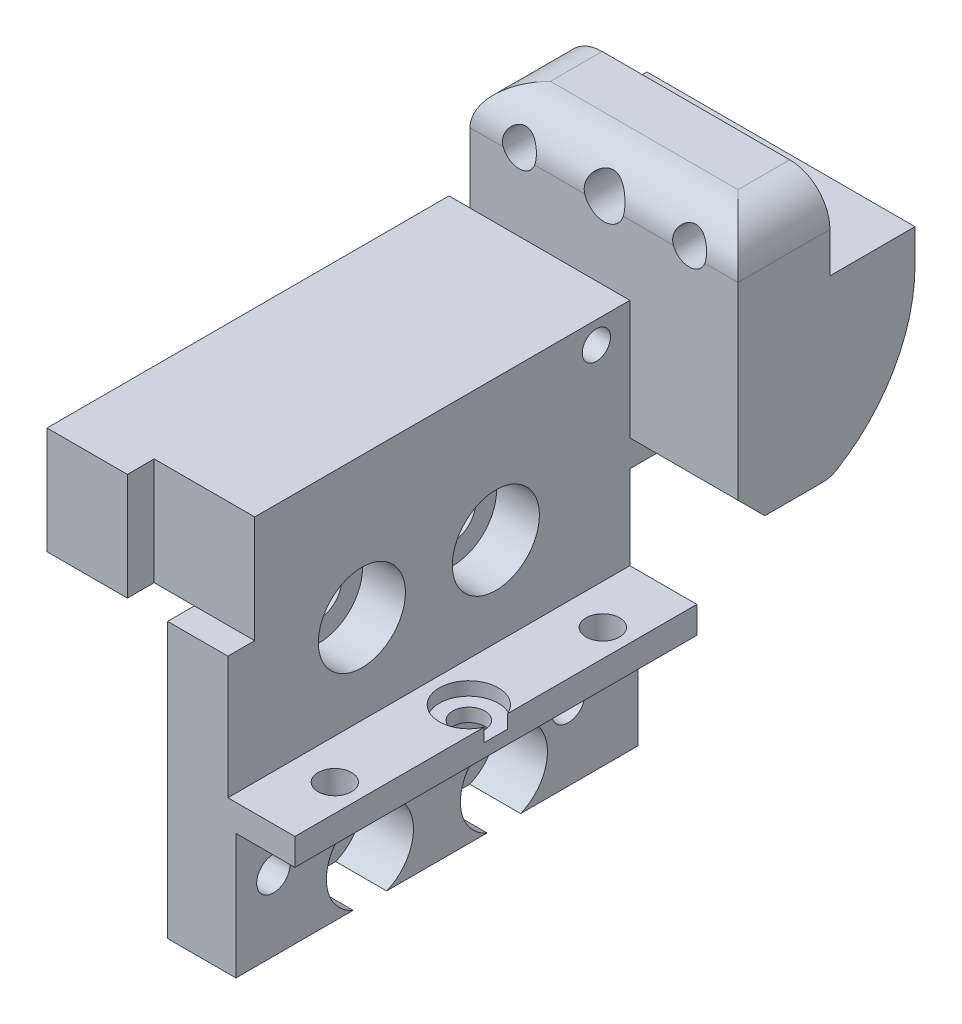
ISO-10303-21;
HEADER;
FILE_DESCRIPTION(('STEP AP214'),'2;1');
FILE_NAME('part.step','',(''),(''),'','','');
FILE_SCHEMA(('AUTOMOTIVE_DESIGN { 1 0 10303 214 1 1 1 1 }'));
ENDSEC;
DATA;
#1=APPLICATION_CONTEXT('core data for automotive mechanical design processes');
#2=APPLICATION_PROTOCOL_DEFINITION('international standard','automotive_design',2000,#1);
#3=PRODUCT_CONTEXT('',#1,'mechanical');
#4=PRODUCT('Part','Part','',(#3));
#5=PRODUCT_RELATED_PRODUCT_CATEGORY('part','',(#4));
#6=PRODUCT_DEFINITION_FORMATION('','',#4);
#7=PRODUCT_DEFINITION_CONTEXT('part definition',#1,'design');
#8=PRODUCT_DEFINITION('design','',#6,#7);
#9=PRODUCT_DEFINITION_SHAPE('','',#8);
#10=(LENGTH_UNIT() NAMED_UNIT(*) SI_UNIT(.MILLI.,.METRE.));
#11=(NAMED_UNIT(*) PLANE_ANGLE_UNIT() SI_UNIT($,.RADIAN.));
#12=(NAMED_UNIT(*) SI_UNIT($,.STERADIAN.) SOLID_ANGLE_UNIT());
#13=UNCERTAINTY_MEASURE_WITH_UNIT(LENGTH_MEASURE(1.E-05),#10,'distance_accuracy_value','');
#14=(GEOMETRIC_REPRESENTATION_CONTEXT(3) GLOBAL_UNCERTAINTY_ASSIGNED_CONTEXT((#13)) GLOBAL_UNIT_ASSIGNED_CONTEXT((#10,
#11,#12)) REPRESENTATION_CONTEXT('',''));
#15=CARTESIAN_POINT('',(0.,0.,0.));
#16=DIRECTION('',(0.,0.,1.));
#17=DIRECTION('',(1.,0.,0.));
#18=AXIS2_PLACEMENT_3D('',#15,#16,#17);
#19=CARTESIAN_POINT('',(0.,0.,0.));
#20=DIRECTION('',(0.,0.,1.));
#21=DIRECTION('',(1.,0.,0.));
#22=AXIS2_PLACEMENT_3D('',#19,#20,#21);
#23=PLANE('',#22);
#24=DIRECTION('',(1.,0.,0.));
#25=VECTOR('',#24,1.);
#26=CARTESIAN_POINT('',(0.,0.,0.));
#27=LINE('',#26,#25);
#28=CARTESIAN_POINT('',(0.,0.,0.));
#29=VERTEX_POINT('',#28);
#30=CARTESIAN_POINT('',(4.5,0.,0.));
#31=VERTEX_POINT('',#30);
#32=EDGE_CURVE('E419',#29,#31,#27,.T.);
#33=ORIENTED_EDGE('',*,*,#32,.F.);
#34=DIRECTION('',(0.,-1.,0.));
#35=VECTOR('',#34,1.);
#36=CARTESIAN_POINT('',(0.,-20.5,0.));
#37=LINE('',#36,#35);
#38=CARTESIAN_POINT('',(0.,-20.5,0.));
#39=VERTEX_POINT('',#38);
#40=EDGE_CURVE('E422',#29,#39,#37,.T.);
#41=ORIENTED_EDGE('',*,*,#40,.T.);
#42=DIRECTION('',(1.,0.,0.));
#43=VECTOR('',#42,1.);
#44=CARTESIAN_POINT('',(5.1,-20.5,0.));
#45=LINE('',#44,#43);
#46=CARTESIAN_POINT('',(5.1,-20.5,0.));
#47=VERTEX_POINT('',#46);
#48=EDGE_CURVE('E439',#39,#47,#45,.T.);
#49=ORIENTED_EDGE('',*,*,#48,.T.);
#50=DIRECTION('',(0.,1.,0.));
#51=VECTOR('',#50,1.);
#52=CARTESIAN_POINT('',(5.1,-11.15,0.));
#53=LINE('',#52,#51);
#54=CARTESIAN_POINT('',(5.1,-11.15,0.));
#55=VERTEX_POINT('',#54);
#56=EDGE_CURVE('E442',#47,#55,#53,.T.);
#57=ORIENTED_EDGE('',*,*,#56,.T.);
#58=DIRECTION('',(1.,0.,0.));
#59=VECTOR('',#58,1.);
#60=CARTESIAN_POINT('',(9.5,-11.15,0.));
#61=LINE('',#60,#59);
#62=CARTESIAN_POINT('',(9.5,-11.15,0.));
#63=VERTEX_POINT('',#62);
#64=EDGE_CURVE('E453',#55,#63,#61,.T.);
#65=ORIENTED_EDGE('',*,*,#64,.T.);
#66=DIRECTION('',(0.,1.,0.));
#67=VECTOR('',#66,1.);
#68=CARTESIAN_POINT('',(9.5,-9.15,0.));
#69=LINE('',#68,#67);
#70=CARTESIAN_POINT('',(9.5,-9.15,0.));
#71=VERTEX_POINT('',#70);
#72=EDGE_CURVE('E456',#63,#71,#69,.T.);
#73=ORIENTED_EDGE('',*,*,#72,.T.);
#74=DIRECTION('',(-1.,0.,0.));
#75=VECTOR('',#74,1.);
#76=CARTESIAN_POINT('',(4.5,-9.15,0.));
#77=LINE('',#76,#75);
#78=CARTESIAN_POINT('',(4.5,-9.15,0.));
#79=VERTEX_POINT('',#78);
#80=EDGE_CURVE('E459',#71,#79,#77,.T.);
#81=ORIENTED_EDGE('',*,*,#80,.T.);
#82=DIRECTION('',(0.,1.,0.));
#83=VECTOR('',#82,1.);
#84=CARTESIAN_POINT('',(4.5,8.,0.));
#85=LINE('',#84,#83);
#86=EDGE_CURVE('E425',#79,#31,#85,.T.);
#87=ORIENTED_EDGE('',*,*,#86,.T.);
#88=EDGE_LOOP('',(#33,#41,#49,#57,#65,#73,#81,#87));
#89=FACE_BOUND('',#88,.T.);
#90=ADVANCED_FACE('F16',(#89),#23,.T.);
#91=CARTESIAN_POINT('',(12.571,-2.888,-30.));
#92=DIRECTION('',(0.,0.,1.));
#93=DIRECTION('',(1.,0.,0.));
#94=AXIS2_PLACEMENT_3D('',#91,#92,#93);
#95=PLANE('',#94);
#96=CARTESIAN_POINT('',(2.571,13.62,-30.));
#97=DIRECTION('',(0.,0.,1.));
#98=DIRECTION('',(1.,0.,0.));
#99=AXIS2_PLACEMENT_3D('',#96,#97,#98);
#100=CIRCLE('',#99,1.5);
#101=CARTESIAN_POINT('',(1.13395441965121,13.19,-30.));
#102=VERTEX_POINT('',#101);
#103=CARTESIAN_POINT('',(4.00804558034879,13.19,-30.));
#104=VERTEX_POINT('',#103);
#105=EDGE_CURVE('E34',#102,#104,#100,.T.);
#106=ORIENTED_EDGE('',*,*,#105,.F.);
#107=DIRECTION('',(-1.,0.,0.));
#108=VECTOR('',#107,1.);
#109=CARTESIAN_POINT('',(12.571,13.19,-30.));
#110=LINE('',#109,#108);
#111=CARTESIAN_POINT('',(-2.60528793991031,13.19,-30.));
#112=VERTEX_POINT('',#111);
#113=EDGE_CURVE('E270',#102,#112,#110,.T.);
#114=ORIENTED_EDGE('',*,*,#113,.T.);
#115=CARTESIAN_POINT('',(-3.779,13.62,-30.));
#116=DIRECTION('',(0.,0.,1.));
#117=DIRECTION('',(1.,0.,0.));
#118=AXIS2_PLACEMENT_3D('',#115,#116,#117);
#119=CIRCLE('',#118,1.24999999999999);
#120=CARTESIAN_POINT('',(-4.95271206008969,13.19,-30.));
#121=VERTEX_POINT('',#120);
#122=EDGE_CURVE('E728',#121,#112,#119,.T.);
#123=ORIENTED_EDGE('',*,*,#122,.F.);
#124=DIRECTION('',(-1.,0.,0.));
#125=VECTOR('',#124,1.);
#126=CARTESIAN_POINT('',(12.571,13.19,-30.));
#127=LINE('',#126,#125);
#128=CARTESIAN_POINT('',(-7.429,13.19,-30.));
#129=VERTEX_POINT('',#128);
#130=EDGE_CURVE('E281',#121,#129,#127,.T.);
#131=ORIENTED_EDGE('',*,*,#130,.T.);
#132=DIRECTION('',(0.,1.,0.));
#133=VECTOR('',#132,1.);
#134=CARTESIAN_POINT('',(-7.429,-2.888,-30.));
#135=LINE('',#134,#133);
#136=CARTESIAN_POINT('',(-7.429,8.,-30.));
#137=VERTEX_POINT('',#136);
#138=EDGE_CURVE('E680',#137,#129,#135,.T.);
#139=ORIENTED_EDGE('',*,*,#138,.F.);
#140=DIRECTION('',(-1.,0.,0.));
#141=VECTOR('',#140,1.);
#142=CARTESIAN_POINT('',(-9.,8.,-30.));
#143=LINE('',#142,#141);
#144=CARTESIAN_POINT('',(4.5,8.,-30.));
#145=VERTEX_POINT('',#144);
#146=EDGE_CURVE('E500',#145,#137,#143,.T.);
#147=ORIENTED_EDGE('',*,*,#146,.F.);
#148=DIRECTION('',(0.,1.,0.));
#149=VECTOR('',#148,1.);
#150=CARTESIAN_POINT('',(4.5,8.,-30.));
#151=LINE('',#150,#149);
#152=CARTESIAN_POINT('',(4.5,-0.887999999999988,-30.));
#153=VERTEX_POINT('',#152);
#154=EDGE_CURVE('E669',#153,#145,#151,.T.);
#155=ORIENTED_EDGE('',*,*,#154,.F.);
#156=DIRECTION('',(1.,0.,0.));
#157=VECTOR('',#156,1.);
#158=CARTESIAN_POINT('',(12.571,-0.887999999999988,-30.));
#159=LINE('',#158,#157);
#160=CARTESIAN_POINT('',(12.571,-0.887999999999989,-30.));
#161=VERTEX_POINT('',#160);
#162=EDGE_CURVE('E614',#153,#161,#159,.T.);
#163=ORIENTED_EDGE('',*,*,#162,.T.);
#164=DIRECTION('',(0.,1.,0.));
#165=VECTOR('',#164,1.);
#166=CARTESIAN_POINT('',(12.571,-2.888,-30.));
#167=LINE('',#166,#165);
#168=CARTESIAN_POINT('',(12.571,13.19,-30.));
#169=VERTEX_POINT('',#168);
#170=EDGE_CURVE('E531',#161,#169,#167,.T.);
#171=ORIENTED_EDGE('',*,*,#170,.T.);
#172=DIRECTION('',(-1.,0.,0.));
#173=VECTOR('',#172,1.);
#174=CARTESIAN_POINT('',(12.571,13.19,-30.));
#175=LINE('',#174,#173);
#176=CARTESIAN_POINT('',(10.0947120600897,13.19,-30.));
#177=VERTEX_POINT('',#176);
#178=EDGE_CURVE('E283',#169,#177,#175,.T.);
#179=ORIENTED_EDGE('',*,*,#178,.T.);
#180=CARTESIAN_POINT('',(8.921,13.62,-30.));
#181=DIRECTION('',(0.,0.,1.));
#182=DIRECTION('',(1.,0.,0.));
#183=AXIS2_PLACEMENT_3D('',#180,#181,#182);
#184=CIRCLE('',#183,1.24999999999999);
#185=CARTESIAN_POINT('',(7.74728793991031,13.19,-30.));
#186=VERTEX_POINT('',#185);
#187=EDGE_CURVE('E511',#186,#177,#184,.T.);
#188=ORIENTED_EDGE('',*,*,#187,.F.);
#189=EDGE_CURVE('E273',#186,#104,#110,.T.);
#190=ORIENTED_EDGE('',*,*,#189,.T.);
#191=EDGE_LOOP('',(#106,#114,#123,#131,#139,#147,#155,#163,#171,#179,#188,#190));
#192=FACE_BOUND('',#191,.T.);
#193=ADVANCED_FACE('F268',(#192),#95,.T.);
#194=CARTESIAN_POINT('',(12.571,16.19,-30.));
#195=DIRECTION('',(0.,1.,0.));
#196=DIRECTION('',(0.,0.,1.));
#197=AXIS2_PLACEMENT_3D('',#194,#195,#196);
#198=PLANE('',#197);
#199=DIRECTION('',(-1.,0.,0.));
#200=VECTOR('',#199,1.);
#201=CARTESIAN_POINT('',(12.571,16.19,-33.));
#202=LINE('',#201,#200);
#203=CARTESIAN_POINT('',(-4.429,16.19,-33.));
#204=VERTEX_POINT('',#203);
#205=CARTESIAN_POINT('',(9.571,16.19,-33.));
#206=VERTEX_POINT('',#205);
#207=EDGE_CURVE('E518',#204,#206,#202,.F.);
#208=ORIENTED_EDGE('',*,*,#207,.T.);
#209=DIRECTION('',(0.,0.,-1.));
#210=VECTOR('',#209,1.);
#211=CARTESIAN_POINT('',(9.571,16.19,-30.));
#212=LINE('',#211,#210);
#213=CARTESIAN_POINT('',(9.571,16.19,-36.86));
#214=VERTEX_POINT('',#213);
#215=EDGE_CURVE('E520',#206,#214,#212,.T.);
#216=ORIENTED_EDGE('',*,*,#215,.T.);
#217=DIRECTION('',(-1.,0.,0.));
#218=VECTOR('',#217,1.);
#219=CARTESIAN_POINT('',(12.571,16.19,-36.86));
#220=LINE('',#219,#218);
#221=CARTESIAN_POINT('',(-4.429,16.19,-36.86));
#222=VERTEX_POINT('',#221);
#223=EDGE_CURVE('E652',#214,#222,#220,.T.);
#224=ORIENTED_EDGE('',*,*,#223,.T.);
#225=DIRECTION('',(0.,0.,-1.));
#226=VECTOR('',#225,1.);
#227=CARTESIAN_POINT('',(-4.429,16.19,-30.));
#228=LINE('',#227,#226);
#229=EDGE_CURVE('E516',#222,#204,#228,.F.);
#230=ORIENTED_EDGE('',*,*,#229,.T.);
#231=EDGE_LOOP('',(#208,#216,#224,#230));
#232=FACE_BOUND('',#231,.T.);
#233=ADVANCED_FACE('F325',(#232),#198,.T.);
#234=CARTESIAN_POINT('',(12.571,-2.888,-30.));
#235=DIRECTION('',(0.,-1.,0.));
#236=DIRECTION('',(0.,0.,-1.));
#237=AXIS2_PLACEMENT_3D('',#234,#235,#236);
#238=PLANE('',#237);
#239=DIRECTION('',(0.,0.,1.));
#240=VECTOR('',#239,1.);
#241=CARTESIAN_POINT('',(12.571,-2.888,-30.));
#242=LINE('',#241,#240);
#243=CARTESIAN_POINT('',(12.571,-2.888,-36.3365445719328));
#244=VERTEX_POINT('',#243);
#245=CARTESIAN_POINT('',(12.571,-2.888,-32.));
#246=VERTEX_POINT('',#245);
#247=EDGE_CURVE('E620',#244,#246,#242,.T.);
#248=ORIENTED_EDGE('',*,*,#247,.T.);
#249=DIRECTION('',(-1.,0.,0.));
#250=VECTOR('',#249,1.);
#251=CARTESIAN_POINT('',(12.571,-2.888,-32.));
#252=LINE('',#251,#250);
#253=CARTESIAN_POINT('',(4.5,-2.888,-32.));
#254=VERTEX_POINT('',#253);
#255=EDGE_CURVE('E611',#246,#254,#252,.T.);
#256=ORIENTED_EDGE('',*,*,#255,.T.);
#257=DIRECTION('',(0.,0.,1.));
#258=VECTOR('',#257,1.);
#259=CARTESIAN_POINT('',(4.5,-2.888,-30.));
#260=LINE('',#259,#258);
#261=CARTESIAN_POINT('',(4.5,-2.888,-30.));
#262=VERTEX_POINT('',#261);
#263=EDGE_CURVE('E429',#254,#262,#260,.T.);
#264=ORIENTED_EDGE('',*,*,#263,.T.);
#265=DIRECTION('',(-1.,0.,0.));
#266=VECTOR('',#265,1.);
#267=CARTESIAN_POINT('',(12.571,-2.888,-30.));
#268=LINE('',#267,#266);
#269=CARTESIAN_POINT('',(0.,-2.888,-30.));
#270=VERTEX_POINT('',#269);
#271=EDGE_CURVE('E473',#262,#270,#268,.T.);
#272=ORIENTED_EDGE('',*,*,#271,.T.);
#273=DIRECTION('',(0.,0.,-1.));
#274=VECTOR('',#273,1.);
#275=CARTESIAN_POINT('',(0.,-2.888,-32.85));
#276=LINE('',#275,#274);
#277=CARTESIAN_POINT('',(0.,-2.888,-32.85));
#278=VERTEX_POINT('',#277);
#279=EDGE_CURVE('E541',#270,#278,#276,.T.);
#280=ORIENTED_EDGE('',*,*,#279,.T.);
#281=DIRECTION('',(-1.,0.,0.));
#282=VECTOR('',#281,1.);
#283=CARTESIAN_POINT('',(4.05746768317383,-2.888,-32.85));
#284=LINE('',#283,#282);
#285=CARTESIAN_POINT('',(-7.429,-2.888,-32.85));
#286=VERTEX_POINT('',#285);
#287=EDGE_CURVE('E742',#278,#286,#284,.T.);
#288=ORIENTED_EDGE('',*,*,#287,.T.);
#289=DIRECTION('',(0.,0.,1.));
#290=VECTOR('',#289,1.);
#291=CARTESIAN_POINT('',(-7.429,-2.888,-36.3365445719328));
#292=LINE('',#291,#290);
#293=CARTESIAN_POINT('',(-7.429,-2.888,-36.3365445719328));
#294=VERTEX_POINT('',#293);
#295=EDGE_CURVE('E684',#294,#286,#292,.T.);
#296=ORIENTED_EDGE('',*,*,#295,.F.);
#297=DIRECTION('',(-1.,0.,0.));
#298=VECTOR('',#297,1.);
#299=CARTESIAN_POINT('',(12.571,-2.888,-36.3365445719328));
#300=LINE('',#299,#298);
#301=EDGE_CURVE('E440',#244,#294,#300,.T.);
#302=ORIENTED_EDGE('',*,*,#301,.F.);
#303=EDGE_LOOP('',(#248,#256,#264,#272,#280,#288,#296,#302));
#304=FACE_BOUND('',#303,.T.);
#305=ADVANCED_FACE('F326',(#304),#238,.T.);
#306=CARTESIAN_POINT('',(12.571,-0.888000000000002,-36.3365445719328));
#307=DIRECTION('',(-1.,0.,0.));
#308=DIRECTION('',(0.,0.,1.));
#309=AXIS2_PLACEMENT_3D('',#306,#307,#308);
#310=CYLINDRICAL_SURFACE('',#309,2.);
#311=ORIENTED_EDGE('',*,*,#301,.T.);
#312=CARTESIAN_POINT('',(-7.429,-0.888000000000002,-36.3365445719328));
#313=DIRECTION('',(-1.,0.,0.));
#314=DIRECTION('',(0.,0.,1.));
#315=AXIS2_PLACEMENT_3D('',#312,#313,#314);
#316=CIRCLE('',#315,2.);
#317=CARTESIAN_POINT('',(-7.429,-2.60600520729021,-37.3604870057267));
#318=VERTEX_POINT('',#317);
#319=EDGE_CURVE('E688',#318,#294,#316,.T.);
#320=ORIENTED_EDGE('',*,*,#319,.F.);
#321=DIRECTION('',(-1.,0.,0.));
#322=VECTOR('',#321,1.);
#323=CARTESIAN_POINT('',(12.571,-2.60600520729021,-37.3604870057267));
#324=LINE('',#323,#322);
#325=CARTESIAN_POINT('',(12.571,-2.60600520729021,-37.3604870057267));
#326=VERTEX_POINT('',#325);
#327=EDGE_CURVE('E445',#326,#318,#324,.T.);
#328=ORIENTED_EDGE('',*,*,#327,.F.);
#329=CARTESIAN_POINT('',(12.571,-0.888000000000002,-36.3365445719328));
#330=DIRECTION('',(-1.,0.,0.));
#331=DIRECTION('',(0.,0.,-1.));
#332=AXIS2_PLACEMENT_3D('',#329,#330,#331);
#333=CIRCLE('',#332,2.);
#334=EDGE_CURVE('E626',#326,#244,#333,.T.);
#335=ORIENTED_EDGE('',*,*,#334,.T.);
#336=EDGE_LOOP('',(#311,#320,#328,#335));
#337=FACE_BOUND('',#336,.T.);
#338=ADVANCED_FACE('F329',(#337),#310,.T.);
#339=CARTESIAN_POINT('',(12.571,7.69,-31.224));
#340=DIRECTION('',(-1.,0.,0.));
#341=DIRECTION('',(0.,0.,1.));
#342=AXIS2_PLACEMENT_3D('',#339,#340,#341);
#343=CYLINDRICAL_SURFACE('',#342,11.986);
#344=ORIENTED_EDGE('',*,*,#327,.T.);
#345=CARTESIAN_POINT('',(-7.429,7.69,-31.224));
#346=DIRECTION('',(-1.,0.,0.));
#347=DIRECTION('',(0.,0.,1.));
#348=AXIS2_PLACEMENT_3D('',#345,#346,#347);
#349=CIRCLE('',#348,11.986);
#350=CARTESIAN_POINT('',(-7.429,7.69,-43.21));
#351=VERTEX_POINT('',#350);
#352=EDGE_CURVE('E713',#351,#318,#349,.T.);
#353=ORIENTED_EDGE('',*,*,#352,.F.);
#354=DIRECTION('',(-1.,0.,0.));
#355=VECTOR('',#354,1.);
#356=CARTESIAN_POINT('',(12.571,7.69,-43.21));
#357=LINE('',#356,#355);
#358=CARTESIAN_POINT('',(12.571,7.69,-43.21));
#359=VERTEX_POINT('',#358);
#360=EDGE_CURVE('E643',#359,#351,#357,.T.);
#361=ORIENTED_EDGE('',*,*,#360,.F.);
#362=CARTESIAN_POINT('',(12.571,7.69,-31.224));
#363=DIRECTION('',(-1.,0.,0.));
#364=DIRECTION('',(0.,0.,-1.));
#365=AXIS2_PLACEMENT_3D('',#362,#363,#364);
#366=CIRCLE('',#365,11.986);
#367=EDGE_CURVE('E706',#359,#326,#366,.T.);
#368=ORIENTED_EDGE('',*,*,#367,.T.);
#369=EDGE_LOOP('',(#344,#353,#361,#368));
#370=FACE_BOUND('',#369,.T.);
#371=ADVANCED_FACE('F333',(#370),#343,.T.);
#372=CARTESIAN_POINT('',(12.571,10.19,-43.21));
#373=DIRECTION('',(0.,0.,-1.));
#374=DIRECTION('',(0.,1.,0.));
#375=AXIS2_PLACEMENT_3D('',#372,#373,#374);
#376=PLANE('',#375);
#377=ORIENTED_EDGE('',*,*,#360,.T.);
#378=DIRECTION('',(0.,-1.,0.));
#379=VECTOR('',#378,1.);
#380=CARTESIAN_POINT('',(-7.429,10.19,-43.21));
#381=LINE('',#380,#379);
#382=CARTESIAN_POINT('',(-7.429,10.19,-43.21));
#383=VERTEX_POINT('',#382);
#384=EDGE_CURVE('E715',#383,#351,#381,.T.);
#385=ORIENTED_EDGE('',*,*,#384,.F.);
#386=DIRECTION('',(-1.,0.,0.));
#387=VECTOR('',#386,1.);
#388=CARTESIAN_POINT('',(12.571,10.19,-43.21));
#389=LINE('',#388,#387);
#390=CARTESIAN_POINT('',(12.571,10.19,-43.21));
#391=VERTEX_POINT('',#390);
#392=EDGE_CURVE('E646',#391,#383,#389,.T.);
#393=ORIENTED_EDGE('',*,*,#392,.F.);
#394=DIRECTION('',(0.,-1.,0.));
#395=VECTOR('',#394,1.);
#396=CARTESIAN_POINT('',(12.571,10.19,-43.21));
#397=LINE('',#396,#395);
#398=EDGE_CURVE('E703',#391,#359,#397,.T.);
#399=ORIENTED_EDGE('',*,*,#398,.T.);
#400=EDGE_LOOP('',(#377,#385,#393,#399));
#401=FACE_BOUND('',#400,.T.);
#402=ADVANCED_FACE('F337',(#401),#376,.T.);
#403=CARTESIAN_POINT('',(12.571,10.19,-36.86));
#404=DIRECTION('',(0.,1.,0.));
#405=DIRECTION('',(0.,0.,1.));
#406=AXIS2_PLACEMENT_3D('',#403,#404,#405);
#407=PLANE('',#406);
#408=ORIENTED_EDGE('',*,*,#392,.T.);
#409=DIRECTION('',(0.,0.,-1.));
#410=VECTOR('',#409,1.);
#411=CARTESIAN_POINT('',(-7.429,10.19,-36.86));
#412=LINE('',#411,#410);
#413=CARTESIAN_POINT('',(-7.429,10.19,-36.86));
#414=VERTEX_POINT('',#413);
#415=EDGE_CURVE('E718',#414,#383,#412,.T.);
#416=ORIENTED_EDGE('',*,*,#415,.F.);
#417=DIRECTION('',(-1.,0.,0.));
#418=VECTOR('',#417,1.);
#419=CARTESIAN_POINT('',(12.571,10.19,-36.86));
#420=LINE('',#419,#418);
#421=CARTESIAN_POINT('',(12.571,10.19,-36.86));
#422=VERTEX_POINT('',#421);
#423=EDGE_CURVE('E649',#422,#414,#420,.T.);
#424=ORIENTED_EDGE('',*,*,#423,.F.);
#425=DIRECTION('',(0.,0.,-1.));
#426=VECTOR('',#425,1.);
#427=CARTESIAN_POINT('',(12.571,10.19,-36.86));
#428=LINE('',#427,#426);
#429=EDGE_CURVE('E700',#422,#391,#428,.T.);
#430=ORIENTED_EDGE('',*,*,#429,.T.);
#431=EDGE_LOOP('',(#408,#416,#424,#430));
#432=FACE_BOUND('',#431,.T.);
#433=ADVANCED_FACE('F341',(#432),#407,.T.);
#434=CARTESIAN_POINT('',(12.571,16.19,-36.86));
#435=DIRECTION('',(0.,0.,-1.));
#436=DIRECTION('',(-1.,0.,0.));
#437=AXIS2_PLACEMENT_3D('',#434,#435,#436);
#438=PLANE('',#437);
#439=CARTESIAN_POINT('',(2.571,13.62,-36.86));
#440=DIRECTION('',(0.,0.,-1.));
#441=DIRECTION('',(-1.,0.,0.));
#442=AXIS2_PLACEMENT_3D('',#439,#440,#441);
#443=CIRCLE('',#442,1.5);
#444=CARTESIAN_POINT('',(1.071,13.62,-36.86));
#445=VERTEX_POINT('',#444);
#446=EDGE_CURVE('E275',#445,#445,#443,.T.);
#447=ORIENTED_EDGE('',*,*,#446,.F.);
#448=EDGE_LOOP('',(#447));
#449=FACE_BOUND('',#448,.T.);
#450=CARTESIAN_POINT('',(-3.779,13.62,-36.86));
#451=DIRECTION('',(0.,0.,-1.));
#452=DIRECTION('',(-1.,0.,0.));
#453=AXIS2_PLACEMENT_3D('',#450,#451,#452);
#454=CIRCLE('',#453,1.24999999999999);
#455=CARTESIAN_POINT('',(-5.02899999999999,13.62,-36.86));
#456=VERTEX_POINT('',#455);
#457=EDGE_CURVE('E544',#456,#456,#454,.T.);
#458=ORIENTED_EDGE('',*,*,#457,.F.);
#459=EDGE_LOOP('',(#458));
#460=FACE_BOUND('',#459,.T.);
#461=CARTESIAN_POINT('',(8.921,13.62,-36.86));
#462=DIRECTION('',(0.,0.,-1.));
#463=DIRECTION('',(-1.,0.,0.));
#464=AXIS2_PLACEMENT_3D('',#461,#462,#463);
#465=CIRCLE('',#464,1.24999999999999);
#466=CARTESIAN_POINT('',(7.67100000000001,13.62,-36.86));
#467=VERTEX_POINT('',#466);
#468=EDGE_CURVE('E515',#467,#467,#465,.T.);
#469=ORIENTED_EDGE('',*,*,#468,.F.);
#470=EDGE_LOOP('',(#469));
#471=FACE_BOUND('',#470,.T.);
#472=ORIENTED_EDGE('',*,*,#223,.F.);
#473=CARTESIAN_POINT('',(9.571,13.19,-36.86));
#474=DIRECTION('',(0.,0.,-1.));
#475=DIRECTION('',(-1.,0.,0.));
#476=AXIS2_PLACEMENT_3D('',#473,#474,#475);
#477=CIRCLE('',#476,3.);
#478=CARTESIAN_POINT('',(12.571,13.19,-36.86));
#479=VERTEX_POINT('',#478);
#480=EDGE_CURVE('E525',#214,#479,#477,.T.);
#481=ORIENTED_EDGE('',*,*,#480,.T.);
#482=DIRECTION('',(0.,-1.,0.));
#483=VECTOR('',#482,1.);
#484=CARTESIAN_POINT('',(12.571,16.19,-36.86));
#485=LINE('',#484,#483);
#486=EDGE_CURVE('E534',#479,#422,#485,.T.);
#487=ORIENTED_EDGE('',*,*,#486,.T.);
#488=ORIENTED_EDGE('',*,*,#423,.T.);
#489=DIRECTION('',(0.,-1.,0.));
#490=VECTOR('',#489,1.);
#491=CARTESIAN_POINT('',(-7.429,16.19,-36.86));
#492=LINE('',#491,#490);
#493=CARTESIAN_POINT('',(-7.429,13.19,-36.86));
#494=VERTEX_POINT('',#493);
#495=EDGE_CURVE('E695',#494,#414,#492,.T.);
#496=ORIENTED_EDGE('',*,*,#495,.F.);
#497=CARTESIAN_POINT('',(-4.429,13.19,-36.86));
#498=DIRECTION('',(0.,0.,-1.));
#499=DIRECTION('',(-1.,0.,0.));
#500=AXIS2_PLACEMENT_3D('',#497,#498,#499);
#501=CIRCLE('',#500,3.);
#502=EDGE_CURVE('E523',#494,#222,#501,.T.);
#503=ORIENTED_EDGE('',*,*,#502,.T.);
#504=EDGE_LOOP('',(#472,#481,#487,#488,#496,#503));
#505=FACE_BOUND('',#504,.T.);
#506=ADVANCED_FACE('F345',(#449,#460,#471,#505),#438,.T.);
#507=CARTESIAN_POINT('',(0.,0.,-30.));
#508=DIRECTION('',(0.,0.,1.));
#509=DIRECTION('',(1.,0.,0.));
#510=AXIS2_PLACEMENT_3D('',#507,#508,#509);
#511=PLANE('',#510);
#512=CARTESIAN_POINT('',(2.25,-17.,-30.));
#513=DIRECTION('',(0.,0.,-1.));
#514=DIRECTION('',(-1.,0.,0.));
#515=AXIS2_PLACEMENT_3D('',#512,#513,#514);
#516=CIRCLE('',#515,1.6);
#517=CARTESIAN_POINT('',(0.649999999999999,-17.,-30.));
#518=VERTEX_POINT('',#517);
#519=EDGE_CURVE('E810',#518,#518,#516,.T.);
#520=ORIENTED_EDGE('',*,*,#519,.F.);
#521=EDGE_LOOP('',(#520));
#522=FACE_BOUND('',#521,.T.);
#523=ORIENTED_EDGE('',*,*,#271,.F.);
#524=CARTESIAN_POINT('',(4.5,-9.15,-30.));
#525=VERTEX_POINT('',#524);
#526=EDGE_CURVE('E503',#525,#262,#151,.T.);
#527=ORIENTED_EDGE('',*,*,#526,.F.);
#528=DIRECTION('',(-1.,0.,0.));
#529=VECTOR('',#528,1.);
#530=CARTESIAN_POINT('',(4.5,-9.15,-30.));
#531=LINE('',#530,#529);
#532=CARTESIAN_POINT('',(9.5,-9.15,-30.));
#533=VERTEX_POINT('',#532);
#534=EDGE_CURVE('E668',#533,#525,#531,.T.);
#535=ORIENTED_EDGE('',*,*,#534,.F.);
#536=DIRECTION('',(0.,1.,0.));
#537=VECTOR('',#536,1.);
#538=CARTESIAN_POINT('',(9.5,-9.15,-30.));
#539=LINE('',#538,#537);
#540=CARTESIAN_POINT('',(9.5,-11.15,-30.));
#541=VERTEX_POINT('',#540);
#542=EDGE_CURVE('E665',#541,#533,#539,.T.);
#543=ORIENTED_EDGE('',*,*,#542,.F.);
#544=DIRECTION('',(1.,0.,0.));
#545=VECTOR('',#544,1.);
#546=CARTESIAN_POINT('',(9.5,-11.15,-30.));
#547=LINE('',#546,#545);
#548=CARTESIAN_POINT('',(5.1,-11.15,-30.));
#549=VERTEX_POINT('',#548);
#550=EDGE_CURVE('E662',#549,#541,#547,.T.);
#551=ORIENTED_EDGE('',*,*,#550,.F.);
#552=DIRECTION('',(0.,1.,0.));
#553=VECTOR('',#552,1.);
#554=CARTESIAN_POINT('',(5.1,-11.15,-30.));
#555=LINE('',#554,#553);
#556=CARTESIAN_POINT('',(5.1,-20.5,-30.));
#557=VERTEX_POINT('',#556);
#558=EDGE_CURVE('E659',#557,#549,#555,.T.);
#559=ORIENTED_EDGE('',*,*,#558,.F.);
#560=DIRECTION('',(1.,0.,0.));
#561=VECTOR('',#560,1.);
#562=CARTESIAN_POINT('',(5.1,-20.5,-30.));
#563=LINE('',#562,#561);
#564=CARTESIAN_POINT('',(0.,-20.5,-30.));
#565=VERTEX_POINT('',#564);
#566=EDGE_CURVE('E656',#565,#557,#563,.T.);
#567=ORIENTED_EDGE('',*,*,#566,.F.);
#568=DIRECTION('',(0.,-1.,0.));
#569=VECTOR('',#568,1.);
#570=CARTESIAN_POINT('',(0.,-20.5,-30.));
#571=LINE('',#570,#569);
#572=EDGE_CURVE('E470',#270,#565,#571,.T.);
#573=ORIENTED_EDGE('',*,*,#572,.F.);
#574=EDGE_LOOP('',(#523,#527,#535,#543,#551,#559,#567,#573));
#575=FACE_BOUND('',#574,.T.);
#576=ADVANCED_FACE('F349',(#522,#575),#511,.F.);
#577=CARTESIAN_POINT('',(0.,-20.5,-30.));
#578=DIRECTION('',(-1.,0.,0.));
#579=DIRECTION('',(0.,0.,1.));
#580=AXIS2_PLACEMENT_3D('',#577,#578,#579);
#581=PLANE('',#580);
#582=CARTESIAN_POINT('',(0.,-16.91,-28.));
#583=DIRECTION('',(-1.,0.,0.));
#584=DIRECTION('',(0.,0.,1.));
#585=AXIS2_PLACEMENT_3D('',#582,#583,#584);
#586=CIRCLE('',#585,0.793749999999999);
#587=CARTESIAN_POINT('',(0.,-16.91,-27.20625));
#588=VERTEX_POINT('',#587);
#589=EDGE_CURVE('E813',#588,#588,#586,.T.);
#590=ORIENTED_EDGE('',*,*,#589,.F.);
#591=EDGE_LOOP('',(#590));
#592=FACE_BOUND('',#591,.T.);
#593=CARTESIAN_POINT('',(0.,-15.15,-2.8));
#594=DIRECTION('',(-1.,0.,0.));
#595=DIRECTION('',(0.,0.,1.));
#596=AXIS2_PLACEMENT_3D('',#593,#594,#595);
#597=CIRCLE('',#596,1.24999999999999);
#598=CARTESIAN_POINT('',(0.,-15.15,-1.55000000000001));
#599=VERTEX_POINT('',#598);
#600=EDGE_CURVE('E592',#599,#599,#597,.T.);
#601=ORIENTED_EDGE('',*,*,#600,.F.);
#602=EDGE_LOOP('',(#601));
#603=FACE_BOUND('',#602,.T.);
#604=CARTESIAN_POINT('',(0.,-15.15,-24.8));
#605=DIRECTION('',(-1.,0.,0.));
#606=DIRECTION('',(0.,0.,1.));
#607=AXIS2_PLACEMENT_3D('',#604,#605,#606);
#608=CIRCLE('',#607,1.24999999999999);
#609=CARTESIAN_POINT('',(0.,-15.15,-23.55));
#610=VERTEX_POINT('',#609);
#611=EDGE_CURVE('E783',#610,#610,#608,.T.);
#612=ORIENTED_EDGE('',*,*,#611,.F.);
#613=EDGE_LOOP('',(#612));
#614=FACE_BOUND('',#613,.T.);
#615=CARTESIAN_POINT('',(0.,-2.5,-20.));
#616=DIRECTION('',(-1.,0.,0.));
#617=DIRECTION('',(0.,0.,1.));
#618=AXIS2_PLACEMENT_3D('',#615,#616,#617);
#619=CIRCLE('',#618,1.7);
#620=CARTESIAN_POINT('',(0.,-2.5,-18.3));
#621=VERTEX_POINT('',#620);
#622=EDGE_CURVE('E584',#621,#621,#619,.T.);
#623=ORIENTED_EDGE('',*,*,#622,.F.);
#624=EDGE_LOOP('',(#623));
#625=FACE_BOUND('',#624,.T.);
#626=CARTESIAN_POINT('',(0.,-17.5,-20.));
#627=DIRECTION('',(-1.,0.,0.));
#628=DIRECTION('',(0.,0.,1.));
#629=AXIS2_PLACEMENT_3D('',#626,#627,#628);
#630=CIRCLE('',#629,1.7);
#631=CARTESIAN_POINT('',(0.,-17.5,-18.3));
#632=VERTEX_POINT('',#631);
#633=EDGE_CURVE('E579',#632,#632,#630,.T.);
#634=ORIENTED_EDGE('',*,*,#633,.F.);
#635=EDGE_LOOP('',(#634));
#636=FACE_BOUND('',#635,.T.);
#637=CARTESIAN_POINT('',(0.,-17.5,-10.));
#638=DIRECTION('',(-1.,0.,0.));
#639=DIRECTION('',(0.,0.,1.));
#640=AXIS2_PLACEMENT_3D('',#637,#638,#639);
#641=CIRCLE('',#640,1.7);
#642=CARTESIAN_POINT('',(0.,-17.5,-8.3));
#643=VERTEX_POINT('',#642);
#644=EDGE_CURVE('E567',#643,#643,#641,.T.);
#645=ORIENTED_EDGE('',*,*,#644,.F.);
#646=EDGE_LOOP('',(#645));
#647=FACE_BOUND('',#646,.T.);
#648=CARTESIAN_POINT('',(0.,-2.5,-10.));
#649=DIRECTION('',(-1.,0.,0.));
#650=DIRECTION('',(0.,0.,1.));
#651=AXIS2_PLACEMENT_3D('',#648,#649,#650);
#652=CIRCLE('',#651,1.7);
#653=CARTESIAN_POINT('',(0.,-2.5,-8.3));
#654=VERTEX_POINT('',#653);
#655=EDGE_CURVE('E551',#654,#654,#652,.T.);
#656=ORIENTED_EDGE('',*,*,#655,.F.);
#657=EDGE_LOOP('',(#656));
#658=FACE_BOUND('',#657,.T.);
#659=ORIENTED_EDGE('',*,*,#40,.F.);
#660=DIRECTION('',(0.,0.,1.));
#661=VECTOR('',#660,1.);
#662=CARTESIAN_POINT('',(0.,0.,-30.));
#663=LINE('',#662,#661);
#664=CARTESIAN_POINT('',(0.,0.,-2.));
#665=VERTEX_POINT('',#664);
#666=EDGE_CURVE('E434',#665,#29,#663,.T.);
#667=ORIENTED_EDGE('',*,*,#666,.F.);
#668=DIRECTION('',(0.,0.,1.));
#669=VECTOR('',#668,1.);
#670=CARTESIAN_POINT('',(0.,0.,-30.));
#671=LINE('',#670,#669);
#672=CARTESIAN_POINT('',(0.,0.,-30.85));
#673=VERTEX_POINT('',#672);
#674=EDGE_CURVE('E471',#673,#665,#671,.T.);
#675=ORIENTED_EDGE('',*,*,#674,.F.);
#676=CARTESIAN_POINT('',(0.,-2.,-30.85));
#677=DIRECTION('',(-1.,0.,0.));
#678=DIRECTION('',(0.,0.,1.));
#679=AXIS2_PLACEMENT_3D('',#676,#677,#678);
#680=CIRCLE('',#679,2.);
#681=CARTESIAN_POINT('',(0.,-2.,-32.85));
#682=VERTEX_POINT('',#681);
#683=EDGE_CURVE('E743',#682,#673,#680,.F.);
#684=ORIENTED_EDGE('',*,*,#683,.F.);
#685=DIRECTION('',(0.,1.,0.));
#686=VECTOR('',#685,1.);
#687=CARTESIAN_POINT('',(0.,-2.,-32.85));
#688=LINE('',#687,#686);
#689=EDGE_CURVE('E547',#278,#682,#688,.T.);
#690=ORIENTED_EDGE('',*,*,#689,.F.);
#691=ORIENTED_EDGE('',*,*,#279,.F.);
#692=ORIENTED_EDGE('',*,*,#572,.T.);
#693=DIRECTION('',(0.,0.,1.));
#694=VECTOR('',#693,1.);
#695=CARTESIAN_POINT('',(0.,-20.5,-30.));
#696=LINE('',#695,#694);
#697=EDGE_CURVE('E437',#565,#39,#696,.T.);
#698=ORIENTED_EDGE('',*,*,#697,.T.);
#699=EDGE_LOOP('',(#659,#667,#675,#684,#690,#691,#692,#698));
#700=FACE_BOUND('',#699,.T.);
#701=ADVANCED_FACE('F356',(#592,#603,#614,#625,#636,#647,#658,#700),#581,.T.);
#702=CARTESIAN_POINT('',(0.,0.,-30.));
#703=DIRECTION('',(0.,-1.,0.));
#704=DIRECTION('',(1.,0.,0.));
#705=AXIS2_PLACEMENT_3D('',#702,#703,#704);
#706=PLANE('',#705);
#707=DIRECTION('',(0.,0.,1.));
#708=VECTOR('',#707,1.);
#709=CARTESIAN_POINT('',(-3.,0.,-2.));
#710=LINE('',#709,#708);
#711=CARTESIAN_POINT('',(-3.,0.,-2.));
#712=VERTEX_POINT('',#711);
#713=CARTESIAN_POINT('',(-3.,0.,0.));
#714=VERTEX_POINT('',#713);
#715=EDGE_CURVE('E1318',#712,#714,#710,.T.);
#716=ORIENTED_EDGE('',*,*,#715,.T.);
#717=DIRECTION('',(1.,0.,0.));
#718=VECTOR('',#717,1.);
#719=CARTESIAN_POINT('',(0.,0.,0.));
#720=LINE('',#719,#718);
#721=CARTESIAN_POINT('',(-9.,0.,0.));
#722=VERTEX_POINT('',#721);
#723=EDGE_CURVE('E467',#722,#714,#720,.T.);
#724=ORIENTED_EDGE('',*,*,#723,.F.);
#725=DIRECTION('',(0.,0.,1.));
#726=VECTOR('',#725,1.);
#727=CARTESIAN_POINT('',(-9.,0.,-30.));
#728=LINE('',#727,#726);
#729=CARTESIAN_POINT('',(-9.,0.,-30.));
#730=VERTEX_POINT('',#729);
#731=EDGE_CURVE('E474',#730,#722,#728,.T.);
#732=ORIENTED_EDGE('',*,*,#731,.F.);
#733=DIRECTION('',(1.,0.,0.));
#734=VECTOR('',#733,1.);
#735=CARTESIAN_POINT('',(0.,0.,-30.));
#736=LINE('',#735,#734);
#737=CARTESIAN_POINT('',(-7.429,0.,-30.));
#738=VERTEX_POINT('',#737);
#739=EDGE_CURVE('E495',#730,#738,#736,.T.);
#740=ORIENTED_EDGE('',*,*,#739,.T.);
#741=DIRECTION('',(0.,0.,-1.));
#742=VECTOR('',#741,1.);
#743=CARTESIAN_POINT('',(-7.429,0.,-30.));
#744=LINE('',#743,#742);
#745=CARTESIAN_POINT('',(-7.429,0.,-30.85));
#746=VERTEX_POINT('',#745);
#747=EDGE_CURVE('E558',#738,#746,#744,.T.);
#748=ORIENTED_EDGE('',*,*,#747,.T.);
#749=DIRECTION('',(-1.,0.,0.));
#750=VECTOR('',#749,1.);
#751=CARTESIAN_POINT('',(4.05746768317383,0.,-30.85));
#752=LINE('',#751,#750);
#753=EDGE_CURVE('E748',#673,#746,#752,.T.);
#754=ORIENTED_EDGE('',*,*,#753,.F.);
#755=ORIENTED_EDGE('',*,*,#674,.T.);
#756=DIRECTION('',(1.,0.,0.));
#757=VECTOR('',#756,1.);
#758=CARTESIAN_POINT('',(4.5,0.,-2.));
#759=LINE('',#758,#757);
#760=EDGE_CURVE('E1320',#712,#665,#759,.T.);
#761=ORIENTED_EDGE('',*,*,#760,.F.);
#762=EDGE_LOOP('',(#716,#724,#732,#740,#748,#754,#755,#761));
#763=FACE_BOUND('',#762,.T.);
#764=ADVANCED_FACE('F362',(#763),#706,.T.);
#765=CARTESIAN_POINT('',(-9.,0.,-30.));
#766=DIRECTION('',(-1.,0.,0.));
#767=DIRECTION('',(0.,0.,1.));
#768=AXIS2_PLACEMENT_3D('',#765,#766,#767);
#769=PLANE('',#768);
#770=CARTESIAN_POINT('',(-9.,6.36,-27.5));
#771=DIRECTION('',(-1.,0.,0.));
#772=DIRECTION('',(0.,0.,1.));
#773=AXIS2_PLACEMENT_3D('',#770,#771,#772);
#774=CIRCLE('',#773,1.0541);
#775=CARTESIAN_POINT('',(-9.,6.36,-26.4459));
#776=VERTEX_POINT('',#775);
#777=EDGE_CURVE('E608',#776,#776,#774,.T.);
#778=ORIENTED_EDGE('',*,*,#777,.F.);
#779=EDGE_LOOP('',(#778));
#780=FACE_BOUND('',#779,.T.);
#781=DIRECTION('',(0.,1.,0.));
#782=VECTOR('',#781,1.);
#783=CARTESIAN_POINT('',(-9.,-2.888,-30.));
#784=LINE('',#783,#782);
#785=CARTESIAN_POINT('',(-9.,8.,-30.));
#786=VERTEX_POINT('',#785);
#787=EDGE_CURVE('E514',#730,#786,#784,.T.);
#788=ORIENTED_EDGE('',*,*,#787,.F.);
#789=ORIENTED_EDGE('',*,*,#731,.T.);
#790=DIRECTION('',(0.,-1.,0.));
#791=VECTOR('',#790,1.);
#792=CARTESIAN_POINT('',(-9.,0.,0.));
#793=LINE('',#792,#791);
#794=CARTESIAN_POINT('',(-9.,8.,0.));
#795=VERTEX_POINT('',#794);
#796=EDGE_CURVE('E464',#795,#722,#793,.T.);
#797=ORIENTED_EDGE('',*,*,#796,.F.);
#798=DIRECTION('',(0.,0.,1.));
#799=VECTOR('',#798,1.);
#800=CARTESIAN_POINT('',(-9.,8.,-30.));
#801=LINE('',#800,#799);
#802=EDGE_CURVE('E478',#786,#795,#801,.T.);
#803=ORIENTED_EDGE('',*,*,#802,.F.);
#804=EDGE_LOOP('',(#788,#789,#797,#803));
#805=FACE_BOUND('',#804,.T.);
#806=ADVANCED_FACE('F365',(#780,#805),#769,.T.);
#807=CARTESIAN_POINT('',(-9.,8.,-30.));
#808=DIRECTION('',(0.,1.,0.));
#809=DIRECTION('',(0.,0.,1.));
#810=AXIS2_PLACEMENT_3D('',#807,#808,#809);
#811=PLANE('',#810);
#812=DIRECTION('',(0.,0.,1.));
#813=VECTOR('',#812,1.);
#814=CARTESIAN_POINT('',(-3.,8.,-2.));
#815=LINE('',#814,#813);
#816=CARTESIAN_POINT('',(-3.,8.,-2.));
#817=VERTEX_POINT('',#816);
#818=CARTESIAN_POINT('',(-3.,8.,0.));
#819=VERTEX_POINT('',#818);
#820=EDGE_CURVE('E1323',#817,#819,#815,.T.);
#821=ORIENTED_EDGE('',*,*,#820,.F.);
#822=DIRECTION('',(-1.,0.,0.));
#823=VECTOR('',#822,1.);
#824=CARTESIAN_POINT('',(4.5,8.,-2.));
#825=LINE('',#824,#823);
#826=CARTESIAN_POINT('',(4.5,8.,-2.));
#827=VERTEX_POINT('',#826);
#828=EDGE_CURVE('E677',#827,#817,#825,.T.);
#829=ORIENTED_EDGE('',*,*,#828,.F.);
#830=DIRECTION('',(0.,0.,1.));
#831=VECTOR('',#830,1.);
#832=CARTESIAN_POINT('',(4.5,8.,-30.));
#833=LINE('',#832,#831);
#834=EDGE_CURVE('E475',#145,#827,#833,.T.);
#835=ORIENTED_EDGE('',*,*,#834,.F.);
#836=ORIENTED_EDGE('',*,*,#146,.T.);
#837=DIRECTION('',(1.,0.,0.));
#838=VECTOR('',#837,1.);
#839=CARTESIAN_POINT('',(-9.,8.,-30.));
#840=LINE('',#839,#838);
#841=EDGE_CURVE('E686',#786,#137,#840,.T.);
#842=ORIENTED_EDGE('',*,*,#841,.F.);
#843=ORIENTED_EDGE('',*,*,#802,.T.);
#844=DIRECTION('',(-1.,0.,0.));
#845=VECTOR('',#844,1.);
#846=CARTESIAN_POINT('',(-9.,8.,0.));
#847=LINE('',#846,#845);
#848=EDGE_CURVE('E462',#819,#795,#847,.T.);
#849=ORIENTED_EDGE('',*,*,#848,.F.);
#850=EDGE_LOOP('',(#821,#829,#835,#836,#842,#843,#849));
#851=FACE_BOUND('',#850,.T.);
#852=ADVANCED_FACE('F369',(#851),#811,.T.);
#853=CARTESIAN_POINT('',(4.5,8.,-30.));
#854=DIRECTION('',(1.,0.,0.));
#855=DIRECTION('',(0.,1.,0.));
#856=AXIS2_PLACEMENT_3D('',#853,#854,#855);
#857=PLANE('',#856);
#858=DIRECTION('',(0.,0.,1.));
#859=VECTOR('',#858,1.);
#860=CARTESIAN_POINT('',(4.5,0.,-2.));
#861=LINE('',#860,#859);
#862=CARTESIAN_POINT('',(4.5,0.,-2.));
#863=VERTEX_POINT('',#862);
#864=EDGE_CURVE('E1322',#863,#31,#861,.T.);
#865=ORIENTED_EDGE('',*,*,#864,.T.);
#866=ORIENTED_EDGE('',*,*,#86,.F.);
#867=DIRECTION('',(0.,0.,1.));
#868=VECTOR('',#867,1.);
#869=CARTESIAN_POINT('',(4.5,-9.15,-30.));
#870=LINE('',#869,#868);
#871=EDGE_CURVE('E479',#525,#79,#870,.T.);
#872=ORIENTED_EDGE('',*,*,#871,.F.);
#873=ORIENTED_EDGE('',*,*,#526,.T.);
#874=ORIENTED_EDGE('',*,*,#263,.F.);
#875=DIRECTION('',(0.,-0.70710678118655,-0.707106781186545));
#876=VECTOR('',#875,1.);
#877=CARTESIAN_POINT('',(4.5,-2.888,-32.));
#878=LINE('',#877,#876);
#879=EDGE_CURVE('E29',#254,#153,#878,.F.);
#880=ORIENTED_EDGE('',*,*,#879,.T.);
#881=ORIENTED_EDGE('',*,*,#154,.T.);
#882=ORIENTED_EDGE('',*,*,#834,.T.);
#883=DIRECTION('',(0.,1.,0.));
#884=VECTOR('',#883,1.);
#885=CARTESIAN_POINT('',(4.5,0.,-2.));
#886=LINE('',#885,#884);
#887=EDGE_CURVE('E1336',#863,#827,#886,.T.);
#888=ORIENTED_EDGE('',*,*,#887,.F.);
#889=EDGE_LOOP('',(#865,#866,#872,#873,#874,#880,#881,#882,#888));
#890=FACE_BOUND('',#889,.T.);
#891=CARTESIAN_POINT('',(4.5,6.36,-27.5));
#892=DIRECTION('',(1.,0.,0.));
#893=DIRECTION('',(0.,1.,0.));
#894=AXIS2_PLACEMENT_3D('',#891,#892,#893);
#895=CIRCLE('',#894,1.0541);
#896=CARTESIAN_POINT('',(4.5,6.36,-26.4459));
#897=VERTEX_POINT('',#896);
#898=EDGE_CURVE('E605',#897,#897,#895,.T.);
#899=ORIENTED_EDGE('',*,*,#898,.F.);
#900=EDGE_LOOP('',(#899));
#901=FACE_BOUND('',#900,.T.);
#902=CARTESIAN_POINT('',(4.5,-2.5,-20.));
#903=DIRECTION('',(1.,0.,0.));
#904=DIRECTION('',(0.,1.,0.));
#905=AXIS2_PLACEMENT_3D('',#902,#903,#904);
#906=CIRCLE('',#905,3.25);
#907=CARTESIAN_POINT('',(4.5,0.750000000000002,-20.));
#908=VERTEX_POINT('',#907);
#909=EDGE_CURVE('E587',#908,#908,#906,.T.);
#910=ORIENTED_EDGE('',*,*,#909,.F.);
#911=EDGE_LOOP('',(#910));
#912=FACE_BOUND('',#911,.T.);
#913=CARTESIAN_POINT('',(4.5,-2.5,-10.));
#914=DIRECTION('',(1.,0.,0.));
#915=DIRECTION('',(0.,1.,0.));
#916=AXIS2_PLACEMENT_3D('',#913,#914,#915);
#917=CIRCLE('',#916,3.25);
#918=CARTESIAN_POINT('',(4.5,0.75,-10.));
#919=VERTEX_POINT('',#918);
#920=EDGE_CURVE('E554',#919,#919,#917,.T.);
#921=ORIENTED_EDGE('',*,*,#920,.F.);
#922=EDGE_LOOP('',(#921));
#923=FACE_BOUND('',#922,.T.);
#924=ADVANCED_FACE('F373',(#890,#901,#912,#923),#857,.T.);
#925=CARTESIAN_POINT('',(4.5,-9.15,-30.));
#926=DIRECTION('',(0.,1.,0.));
#927=DIRECTION('',(0.,0.,1.));
#928=AXIS2_PLACEMENT_3D('',#925,#926,#927);
#929=PLANE('',#928);
#930=CARTESIAN_POINT('',(7.481,-9.15,-25.));
#931=DIRECTION('',(0.,1.,0.));
#932=DIRECTION('',(0.,0.,1.));
#933=AXIS2_PLACEMENT_3D('',#930,#931,#932);
#934=CIRCLE('',#933,1.24999999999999);
#935=CARTESIAN_POINT('',(7.481,-9.15,-23.75));
#936=VERTEX_POINT('',#935);
#937=EDGE_CURVE('E806',#936,#936,#934,.T.);
#938=ORIENTED_EDGE('',*,*,#937,.F.);
#939=EDGE_LOOP('',(#938));
#940=FACE_BOUND('',#939,.T.);
#941=CARTESIAN_POINT('',(7.481,-9.15,-5.));
#942=DIRECTION('',(0.,1.,0.));
#943=DIRECTION('',(0.,0.,1.));
#944=AXIS2_PLACEMENT_3D('',#941,#942,#943);
#945=CIRCLE('',#944,1.24999999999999);
#946=CARTESIAN_POINT('',(7.481,-9.15,-3.75000000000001));
#947=VERTEX_POINT('',#946);
#948=EDGE_CURVE('E800',#947,#947,#945,.T.);
#949=ORIENTED_EDGE('',*,*,#948,.F.);
#950=EDGE_LOOP('',(#949));
#951=FACE_BOUND('',#950,.T.);
#952=CARTESIAN_POINT('',(7.481,-9.15,-15.));
#953=DIRECTION('',(0.,1.,0.));
#954=DIRECTION('',(0.,0.,1.));
#955=AXIS2_PLACEMENT_3D('',#952,#953,#954);
#956=CIRCLE('',#955,2.2);
#957=CARTESIAN_POINT('',(9.5,-9.15,-15.8738644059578));
#958=VERTEX_POINT('',#957);
#959=CARTESIAN_POINT('',(9.5,-9.15,-14.1261355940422));
#960=VERTEX_POINT('',#959);
#961=EDGE_CURVE('E795',#958,#960,#956,.T.);
#962=ORIENTED_EDGE('',*,*,#961,.F.);
#963=DIRECTION('',(0.,0.,1.));
#964=VECTOR('',#963,1.);
#965=CARTESIAN_POINT('',(9.5,-9.15,-30.));
#966=LINE('',#965,#964);
#967=EDGE_CURVE('E481',#533,#958,#966,.T.);
#968=ORIENTED_EDGE('',*,*,#967,.F.);
#969=ORIENTED_EDGE('',*,*,#534,.T.);
#970=ORIENTED_EDGE('',*,*,#871,.T.);
#971=ORIENTED_EDGE('',*,*,#80,.F.);
#972=EDGE_CURVE('E484',#960,#71,#966,.T.);
#973=ORIENTED_EDGE('',*,*,#972,.F.);
#974=EDGE_LOOP('',(#962,#968,#969,#970,#971,#973));
#975=FACE_BOUND('',#974,.T.);
#976=ADVANCED_FACE('F377',(#940,#951,#975),#929,.T.);
#977=CARTESIAN_POINT('',(9.5,-9.15,-30.));
#978=DIRECTION('',(1.,0.,0.));
#979=DIRECTION('',(0.,1.,0.));
#980=AXIS2_PLACEMENT_3D('',#977,#978,#979);
#981=PLANE('',#980);
#982=DIRECTION('',(0.,1.,0.));
#983=VECTOR('',#982,1.);
#984=CARTESIAN_POINT('',(9.5,-9.15,-15.8738644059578));
#985=LINE('',#984,#983);
#986=CARTESIAN_POINT('',(9.5,-10.15,-15.8738644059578));
#987=VERTEX_POINT('',#986);
#988=EDGE_CURVE('E430',#987,#958,#985,.T.);
#989=ORIENTED_EDGE('',*,*,#988,.F.);
#990=DIRECTION('',(0.,0.,-1.));
#991=VECTOR('',#990,1.);
#992=CARTESIAN_POINT('',(9.5,-10.15,-30.));
#993=LINE('',#992,#991);
#994=CARTESIAN_POINT('',(9.5,-10.15,-14.1261355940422));
#995=VERTEX_POINT('',#994);
#996=EDGE_CURVE('E602',#995,#987,#993,.T.);
#997=ORIENTED_EDGE('',*,*,#996,.F.);
#998=DIRECTION('',(0.,1.,0.));
#999=VECTOR('',#998,1.);
#1000=CARTESIAN_POINT('',(9.5,-9.15,-14.1261355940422));
#1001=LINE('',#1000,#999);
#1002=EDGE_CURVE('E578',#960,#995,#1001,.F.);
#1003=ORIENTED_EDGE('',*,*,#1002,.F.);
#1004=ORIENTED_EDGE('',*,*,#972,.T.);
#1005=ORIENTED_EDGE('',*,*,#72,.F.);
#1006=DIRECTION('',(0.,0.,1.));
#1007=VECTOR('',#1006,1.);
#1008=CARTESIAN_POINT('',(9.5,-11.15,-30.));
#1009=LINE('',#1008,#1007);
#1010=EDGE_CURVE('E485',#541,#63,#1009,.T.);
#1011=ORIENTED_EDGE('',*,*,#1010,.F.);
#1012=ORIENTED_EDGE('',*,*,#542,.T.);
#1013=ORIENTED_EDGE('',*,*,#967,.T.);
#1014=EDGE_LOOP('',(#989,#997,#1003,#1004,#1005,#1011,#1012,#1013));
#1015=FACE_BOUND('',#1014,.T.);
#1016=ADVANCED_FACE('F380',(#1015),#981,.T.);
#1017=CARTESIAN_POINT('',(9.5,-11.15,-30.));
#1018=DIRECTION('',(0.,-1.,0.));
#1019=DIRECTION('',(0.,0.,-1.));
#1020=AXIS2_PLACEMENT_3D('',#1017,#1018,#1019);
#1021=PLANE('',#1020);
#1022=CARTESIAN_POINT('',(7.481,-11.15,-25.));
#1023=DIRECTION('',(0.,-1.,0.));
#1024=DIRECTION('',(0.,0.,-1.));
#1025=AXIS2_PLACEMENT_3D('',#1022,#1023,#1024);
#1026=CIRCLE('',#1025,1.24999999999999);
#1027=CARTESIAN_POINT('',(7.481,-11.15,-26.25));
#1028=VERTEX_POINT('',#1027);
#1029=EDGE_CURVE('E803',#1028,#1028,#1026,.T.);
#1030=ORIENTED_EDGE('',*,*,#1029,.F.);
#1031=EDGE_LOOP('',(#1030));
#1032=FACE_BOUND('',#1031,.T.);
#1033=CARTESIAN_POINT('',(7.481,-11.15,-5.));
#1034=DIRECTION('',(0.,-1.,0.));
#1035=DIRECTION('',(0.,0.,-1.));
#1036=AXIS2_PLACEMENT_3D('',#1033,#1034,#1035);
#1037=CIRCLE('',#1036,1.24999999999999);
#1038=CARTESIAN_POINT('',(7.481,-11.15,-6.24999999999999));
#1039=VERTEX_POINT('',#1038);
#1040=EDGE_CURVE('E797',#1039,#1039,#1037,.T.);
#1041=ORIENTED_EDGE('',*,*,#1040,.F.);
#1042=EDGE_LOOP('',(#1041));
#1043=FACE_BOUND('',#1042,.T.);
#1044=CARTESIAN_POINT('',(7.481,-11.15,-15.));
#1045=DIRECTION('',(0.,-1.,0.));
#1046=DIRECTION('',(0.,0.,-1.));
#1047=AXIS2_PLACEMENT_3D('',#1044,#1045,#1046);
#1048=CIRCLE('',#1047,1.2);
#1049=CARTESIAN_POINT('',(7.481,-11.15,-16.2));
#1050=VERTEX_POINT('',#1049);
#1051=EDGE_CURVE('E597',#1050,#1050,#1048,.T.);
#1052=ORIENTED_EDGE('',*,*,#1051,.F.);
#1053=EDGE_LOOP('',(#1052));
#1054=FACE_BOUND('',#1053,.T.);
#1055=ORIENTED_EDGE('',*,*,#64,.F.);
#1056=DIRECTION('',(0.,0.,1.));
#1057=VECTOR('',#1056,1.);
#1058=CARTESIAN_POINT('',(5.1,-11.15,-30.));
#1059=LINE('',#1058,#1057);
#1060=EDGE_CURVE('E487',#549,#55,#1059,.T.);
#1061=ORIENTED_EDGE('',*,*,#1060,.F.);
#1062=ORIENTED_EDGE('',*,*,#550,.T.);
#1063=ORIENTED_EDGE('',*,*,#1010,.T.);
#1064=EDGE_LOOP('',(#1055,#1061,#1062,#1063));
#1065=FACE_BOUND('',#1064,.T.);
#1066=ADVANCED_FACE('F384',(#1032,#1043,#1054,#1065),#1021,.T.);
#1067=CARTESIAN_POINT('',(5.1,-11.15,-30.));
#1068=DIRECTION('',(1.,0.,0.));
#1069=DIRECTION('',(0.,1.,0.));
#1070=AXIS2_PLACEMENT_3D('',#1067,#1068,#1069);
#1071=PLANE('',#1070);
#1072=CARTESIAN_POINT('',(5.1,-15.15,-2.8));
#1073=DIRECTION('',(1.,0.,0.));
#1074=DIRECTION('',(0.,0.,-1.));
#1075=AXIS2_PLACEMENT_3D('',#1072,#1073,#1074);
#1076=CIRCLE('',#1075,1.24999999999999);
#1077=CARTESIAN_POINT('',(5.1,-15.15,-4.04999999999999));
#1078=VERTEX_POINT('',#1077);
#1079=EDGE_CURVE('E596',#1078,#1078,#1076,.T.);
#1080=ORIENTED_EDGE('',*,*,#1079,.F.);
#1081=EDGE_LOOP('',(#1080));
#1082=FACE_BOUND('',#1081,.T.);
#1083=CARTESIAN_POINT('',(5.1,-15.15,-24.8));
#1084=DIRECTION('',(1.,0.,0.));
#1085=DIRECTION('',(0.,0.,-1.));
#1086=AXIS2_PLACEMENT_3D('',#1083,#1084,#1085);
#1087=CIRCLE('',#1086,1.24999999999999);
#1088=CARTESIAN_POINT('',(5.1,-15.15,-26.05));
#1089=VERTEX_POINT('',#1088);
#1090=EDGE_CURVE('E595',#1089,#1089,#1087,.T.);
#1091=ORIENTED_EDGE('',*,*,#1090,.F.);
#1092=EDGE_LOOP('',(#1091));
#1093=FACE_BOUND('',#1092,.T.);
#1094=CARTESIAN_POINT('',(5.10000000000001,-17.5,-20.));
#1095=DIRECTION('',(1.,0.,0.));
#1096=DIRECTION('',(0.,0.,-1.));
#1097=AXIS2_PLACEMENT_3D('',#1094,#1095,#1096);
#1098=CIRCLE('',#1097,3.25);
#1099=CARTESIAN_POINT('',(5.10000000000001,-20.5,-21.25));
#1100=VERTEX_POINT('',#1099);
#1101=CARTESIAN_POINT('',(5.10000000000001,-20.5,-18.75));
#1102=VERTEX_POINT('',#1101);
#1103=EDGE_CURVE('E591',#1100,#1102,#1098,.T.);
#1104=ORIENTED_EDGE('',*,*,#1103,.F.);
#1105=DIRECTION('',(0.,0.,1.));
#1106=VECTOR('',#1105,1.);
#1107=CARTESIAN_POINT('',(5.1,-20.5,-30.));
#1108=LINE('',#1107,#1106);
#1109=EDGE_CURVE('E489',#557,#1100,#1108,.T.);
#1110=ORIENTED_EDGE('',*,*,#1109,.F.);
#1111=ORIENTED_EDGE('',*,*,#558,.T.);
#1112=ORIENTED_EDGE('',*,*,#1060,.T.);
#1113=ORIENTED_EDGE('',*,*,#56,.F.);
#1114=CARTESIAN_POINT('',(5.1,-20.5,-8.75000000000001));
#1115=VERTEX_POINT('',#1114);
#1116=EDGE_CURVE('E493',#1115,#47,#1108,.T.);
#1117=ORIENTED_EDGE('',*,*,#1116,.F.);
#1118=CARTESIAN_POINT('',(5.10000000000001,-17.5,-10.));
#1119=DIRECTION('',(1.,0.,0.));
#1120=DIRECTION('',(0.,0.,-1.));
#1121=AXIS2_PLACEMENT_3D('',#1118,#1119,#1120);
#1122=CIRCLE('',#1121,3.25);
#1123=CARTESIAN_POINT('',(5.10000000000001,-20.5,-11.25));
#1124=VERTEX_POINT('',#1123);
#1125=EDGE_CURVE('E582',#1124,#1115,#1122,.T.);
#1126=ORIENTED_EDGE('',*,*,#1125,.F.);
#1127=EDGE_CURVE('E492',#1102,#1124,#1108,.T.);
#1128=ORIENTED_EDGE('',*,*,#1127,.F.);
#1129=EDGE_LOOP('',(#1104,#1110,#1111,#1112,#1113,#1117,#1126,#1128));
#1130=FACE_BOUND('',#1129,.T.);
#1131=ADVANCED_FACE('F388',(#1082,#1093,#1130),#1071,.T.);
#1132=CARTESIAN_POINT('',(5.1,-20.5,-30.));
#1133=DIRECTION('',(0.,-1.,0.));
#1134=DIRECTION('',(0.,0.,-1.));
#1135=AXIS2_PLACEMENT_3D('',#1132,#1133,#1134);
#1136=PLANE('',#1135);
#1137=DIRECTION('',(1.,0.,0.));
#1138=VECTOR('',#1137,1.);
#1139=CARTESIAN_POINT('',(5.10000000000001,-20.5,-21.25));
#1140=LINE('',#1139,#1138);
#1141=CARTESIAN_POINT('',(1.30000000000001,-20.5,-21.25));
#1142=VERTEX_POINT('',#1141);
#1143=EDGE_CURVE('E576',#1142,#1100,#1140,.T.);
#1144=ORIENTED_EDGE('',*,*,#1143,.F.);
#1145=DIRECTION('',(0.,0.,-1.));
#1146=VECTOR('',#1145,1.);
#1147=CARTESIAN_POINT('',(1.30000000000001,-20.5,-30.));
#1148=LINE('',#1147,#1146);
#1149=CARTESIAN_POINT('',(1.30000000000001,-20.5,-18.75));
#1150=VERTEX_POINT('',#1149);
#1151=EDGE_CURVE('E566',#1150,#1142,#1148,.T.);
#1152=ORIENTED_EDGE('',*,*,#1151,.F.);
#1153=DIRECTION('',(1.,0.,0.));
#1154=VECTOR('',#1153,1.);
#1155=CARTESIAN_POINT('',(5.10000000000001,-20.5,-18.75));
#1156=LINE('',#1155,#1154);
#1157=EDGE_CURVE('E573',#1102,#1150,#1156,.F.);
#1158=ORIENTED_EDGE('',*,*,#1157,.F.);
#1159=ORIENTED_EDGE('',*,*,#1127,.T.);
#1160=DIRECTION('',(1.,0.,0.));
#1161=VECTOR('',#1160,1.);
#1162=CARTESIAN_POINT('',(5.10000000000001,-20.5,-11.25));
#1163=LINE('',#1162,#1161);
#1164=CARTESIAN_POINT('',(1.30000000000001,-20.5,-11.25));
#1165=VERTEX_POINT('',#1164);
#1166=EDGE_CURVE('E563',#1165,#1124,#1163,.T.);
#1167=ORIENTED_EDGE('',*,*,#1166,.F.);
#1168=DIRECTION('',(0.,0.,-1.));
#1169=VECTOR('',#1168,1.);
#1170=CARTESIAN_POINT('',(1.30000000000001,-20.5,-30.));
#1171=LINE('',#1170,#1169);
#1172=CARTESIAN_POINT('',(1.30000000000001,-20.5,-8.75000000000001));
#1173=VERTEX_POINT('',#1172);
#1174=EDGE_CURVE('E561',#1173,#1165,#1171,.T.);
#1175=ORIENTED_EDGE('',*,*,#1174,.F.);
#1176=DIRECTION('',(1.,0.,0.));
#1177=VECTOR('',#1176,1.);
#1178=CARTESIAN_POINT('',(5.10000000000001,-20.5,-8.75000000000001));
#1179=LINE('',#1178,#1177);
#1180=EDGE_CURVE('E559',#1115,#1173,#1179,.F.);
#1181=ORIENTED_EDGE('',*,*,#1180,.F.);
#1182=ORIENTED_EDGE('',*,*,#1116,.T.);
#1183=ORIENTED_EDGE('',*,*,#48,.F.);
#1184=ORIENTED_EDGE('',*,*,#697,.F.);
#1185=ORIENTED_EDGE('',*,*,#566,.T.);
#1186=ORIENTED_EDGE('',*,*,#1109,.T.);
#1187=EDGE_LOOP('',(#1144,#1152,#1158,#1159,#1167,#1175,#1181,#1182,#1183,#1184,#1185,#1186));
#1188=FACE_BOUND('',#1187,.T.);
#1189=ADVANCED_FACE('F360',(#1188),#1136,.T.);
#1190=DIRECTION('',(0.,-1.,0.));
#1191=VECTOR('',#1190,1.);
#1192=CARTESIAN_POINT('',(-3.,0.,0.));
#1193=LINE('',#1192,#1191);
#1194=EDGE_CURVE('E274',#819,#714,#1193,.T.);
#1195=ORIENTED_EDGE('',*,*,#1194,.F.);
#1196=ORIENTED_EDGE('',*,*,#848,.T.);
#1197=ORIENTED_EDGE('',*,*,#796,.T.);
#1198=ORIENTED_EDGE('',*,*,#723,.T.);
#1199=EDGE_LOOP('',(#1195,#1196,#1197,#1198));
#1200=FACE_BOUND('',#1199,.T.);
#1201=ADVANCED_FACE('F321',(#1200),#23,.T.);
#1202=CARTESIAN_POINT('',(12.571,7.69,-31.224));
#1203=DIRECTION('',(1.,0.,0.));
#1204=DIRECTION('',(0.,0.,-1.));
#1205=AXIS2_PLACEMENT_3D('',#1202,#1203,#1204);
#1206=PLANE('',#1205);
#1207=ORIENTED_EDGE('',*,*,#170,.F.);
#1208=DIRECTION('',(0.,0.70710678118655,0.707106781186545));
#1209=VECTOR('',#1208,1.);
#1210=CARTESIAN_POINT('',(12.571,2.78900000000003,-26.323));
#1211=LINE('',#1210,#1209);
#1212=EDGE_CURVE('E616',#161,#246,#1211,.F.);
#1213=ORIENTED_EDGE('',*,*,#1212,.T.);
#1214=ORIENTED_EDGE('',*,*,#247,.F.);
#1215=ORIENTED_EDGE('',*,*,#334,.F.);
#1216=ORIENTED_EDGE('',*,*,#367,.F.);
#1217=ORIENTED_EDGE('',*,*,#398,.F.);
#1218=ORIENTED_EDGE('',*,*,#429,.F.);
#1219=ORIENTED_EDGE('',*,*,#486,.F.);
#1220=DIRECTION('',(0.,0.,-1.));
#1221=VECTOR('',#1220,1.);
#1222=CARTESIAN_POINT('',(12.571,13.19,-31.224));
#1223=LINE('',#1222,#1221);
#1224=EDGE_CURVE('E284',#479,#169,#1223,.F.);
#1225=ORIENTED_EDGE('',*,*,#1224,.T.);
#1226=EDGE_LOOP('',(#1207,#1213,#1214,#1215,#1216,#1217,#1218,#1219,#1225));
#1227=FACE_BOUND('',#1226,.T.);
#1228=ADVANCED_FACE('F317',(#1227),#1206,.T.);
#1229=CARTESIAN_POINT('',(-7.429,-2.888,-30.));
#1230=DIRECTION('',(0.,0.,1.));
#1231=DIRECTION('',(1.,0.,0.));
#1232=AXIS2_PLACEMENT_3D('',#1229,#1230,#1231);
#1233=PLANE('',#1232);
#1234=ORIENTED_EDGE('',*,*,#739,.F.);
#1235=ORIENTED_EDGE('',*,*,#787,.T.);
#1236=ORIENTED_EDGE('',*,*,#841,.T.);
#1237=EDGE_CURVE('E683',#738,#137,#135,.T.);
#1238=ORIENTED_EDGE('',*,*,#1237,.F.);
#1239=EDGE_LOOP('',(#1234,#1235,#1236,#1238));
#1240=FACE_BOUND('',#1239,.T.);
#1241=ADVANCED_FACE('F313',(#1240),#1233,.F.);
#1242=CARTESIAN_POINT('',(-7.429,7.69,-31.224));
#1243=DIRECTION('',(-1.,0.,0.));
#1244=DIRECTION('',(0.,0.,1.));
#1245=AXIS2_PLACEMENT_3D('',#1242,#1243,#1244);
#1246=PLANE('',#1245);
#1247=DIRECTION('',(0.,-1.,0.));
#1248=VECTOR('',#1247,1.);
#1249=CARTESIAN_POINT('',(-7.429,-2.,-32.85));
#1250=LINE('',#1249,#1248);
#1251=CARTESIAN_POINT('',(-7.429,-2.,-32.85));
#1252=VERTEX_POINT('',#1251);
#1253=EDGE_CURVE('E751',#1252,#286,#1250,.T.);
#1254=ORIENTED_EDGE('',*,*,#1253,.F.);
#1255=CARTESIAN_POINT('',(-7.429,-2.,-30.85));
#1256=DIRECTION('',(-1.,0.,0.));
#1257=DIRECTION('',(0.,0.,-1.));
#1258=AXIS2_PLACEMENT_3D('',#1255,#1256,#1257);
#1259=CIRCLE('',#1258,2.);
#1260=EDGE_CURVE('E757',#746,#1252,#1259,.T.);
#1261=ORIENTED_EDGE('',*,*,#1260,.F.);
#1262=ORIENTED_EDGE('',*,*,#747,.F.);
#1263=ORIENTED_EDGE('',*,*,#1237,.T.);
#1264=ORIENTED_EDGE('',*,*,#138,.T.);
#1265=DIRECTION('',(0.,0.,-1.));
#1266=VECTOR('',#1265,1.);
#1267=CARTESIAN_POINT('',(-7.429,13.19,-31.224));
#1268=LINE('',#1267,#1266);
#1269=EDGE_CURVE('E549',#129,#494,#1268,.T.);
#1270=ORIENTED_EDGE('',*,*,#1269,.T.);
#1271=ORIENTED_EDGE('',*,*,#495,.T.);
#1272=ORIENTED_EDGE('',*,*,#415,.T.);
#1273=ORIENTED_EDGE('',*,*,#384,.T.);
#1274=ORIENTED_EDGE('',*,*,#352,.T.);
#1275=ORIENTED_EDGE('',*,*,#319,.T.);
#1276=ORIENTED_EDGE('',*,*,#295,.T.);
#1277=EDGE_LOOP('',(#1254,#1261,#1262,#1263,#1264,#1270,#1271,#1272,#1273,#1274,#1275,#1276));
#1278=FACE_BOUND('',#1277,.T.);
#1279=ADVANCED_FACE('F307',(#1278),#1246,.T.);
#1280=CARTESIAN_POINT('',(8.921,13.62,-36.86));
#1281=DIRECTION('',(0.,0.,-1.));
#1282=DIRECTION('',(-1.,0.,0.));
#1283=AXIS2_PLACEMENT_3D('',#1280,#1281,#1282);
#1284=CYLINDRICAL_SURFACE('',#1283,1.24999999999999);
#1285=ORIENTED_EDGE('',*,*,#187,.T.);
#1286=CARTESIAN_POINT('',(10.0947120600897,13.19,-30.));
#1287=CARTESIAN_POINT('',(10.106085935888,13.2210431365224,-29.9999979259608));
#1288=CARTESIAN_POINT('',(10.116220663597,13.2525249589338,-30.0004825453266));
#1289=CARTESIAN_POINT('',(10.1339600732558,13.3161587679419,-30.0024849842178));
#1290=CARTESIAN_POINT('',(10.1415649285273,13.3483107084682,-30.0040027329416));
#1291=CARTESIAN_POINT('',(10.1604612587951,13.4452217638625,-30.0101798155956));
#1292=CARTESIAN_POINT('',(10.1679214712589,13.5106747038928,-30.0164620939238));
#1293=CARTESIAN_POINT('',(10.1725301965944,13.6413521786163,-30.0334139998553));
#1294=CARTESIAN_POINT('',(10.1696750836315,13.7065766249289,-30.0440851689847));
#1295=CARTESIAN_POINT('',(10.1540643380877,13.8350347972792,-30.0694338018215));
#1296=CARTESIAN_POINT('',(10.1413057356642,13.8982679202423,-30.0841124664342));
#1297=CARTESIAN_POINT('',(10.1061379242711,14.0227926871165,-30.1171691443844));
#1298=CARTESIAN_POINT('',(10.0834925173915,14.0839946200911,-30.1356314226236));
#1299=CARTESIAN_POINT('',(10.0293861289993,14.2015244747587,-30.174992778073));
#1300=CARTESIAN_POINT('',(9.99792084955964,14.2578500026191,-30.1958930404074));
#1301=CARTESIAN_POINT('',(9.92359838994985,14.3698234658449,-30.2410148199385));
#1302=CARTESIAN_POINT('',(9.87993792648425,14.4248880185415,-30.2653626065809));
#1303=CARTESIAN_POINT('',(9.78394475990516,14.5270534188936,-30.3138332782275));
#1304=CARTESIAN_POINT('',(9.73160489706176,14.5741476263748,-30.3379559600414));
#1305=CARTESIAN_POINT('',(9.61584978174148,14.6617538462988,-30.3853183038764));
#1306=CARTESIAN_POINT('',(9.55196913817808,14.7017278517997,-30.4084262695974));
#1307=CARTESIAN_POINT('',(9.4167247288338,14.7699891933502,-30.4494646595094));
#1308=CARTESIAN_POINT('',(9.34537006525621,14.798290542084,-30.4674012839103));
#1309=CARTESIAN_POINT('',(9.20453355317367,14.8394023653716,-30.494003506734));
#1310=CARTESIAN_POINT('',(9.13556354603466,14.85346736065,-30.5034101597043));
#1311=CARTESIAN_POINT('',(8.99565834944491,14.8697464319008,-30.5143291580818));
#1312=CARTESIAN_POINT('',(8.92472597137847,14.8719766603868,-30.5158522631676));
#1313=CARTESIAN_POINT('',(8.79468315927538,14.8650383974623,-30.5111752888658));
#1314=CARTESIAN_POINT('',(8.73542921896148,14.8575668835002,-30.5061247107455));
#1315=CARTESIAN_POINT('',(8.61922694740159,14.8344722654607,-30.4908365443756));
#1316=CARTESIAN_POINT('',(8.5622794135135,14.8188463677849,-30.4805971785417));
#1317=CARTESIAN_POINT('',(8.45096761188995,14.7797908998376,-30.4557703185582));
#1318=CARTESIAN_POINT('',(8.39666831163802,14.7562258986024,-30.4411078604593));
#1319=CARTESIAN_POINT('',(8.29262036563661,14.702164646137,-30.4087939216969));
#1320=CARTESIAN_POINT('',(8.24287335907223,14.6716659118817,-30.3911413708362));
#1321=CARTESIAN_POINT('',(8.14117406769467,14.5992095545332,-30.3512095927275));
#1322=CARTESIAN_POINT('',(8.09007954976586,14.5562078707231,-30.3286376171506));
#1323=CARTESIAN_POINT('',(7.99545587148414,14.4627896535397,-30.2828846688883));
#1324=CARTESIAN_POINT('',(7.95193309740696,14.4123669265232,-30.2597032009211));
#1325=CARTESIAN_POINT('',(7.86892336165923,14.2990377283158,-30.2117714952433));
#1326=CARTESIAN_POINT('',(7.83040710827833,14.2353681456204,-30.1871292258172));
#1327=CARTESIAN_POINT('',(7.76497423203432,14.10131075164,-30.1408863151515));
#1328=CARTESIAN_POINT('',(7.738052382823,14.0309259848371,-30.1192843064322));
#1329=CARTESIAN_POINT('',(7.69789545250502,13.8879857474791,-30.0814261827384));
#1330=CARTESIAN_POINT('',(7.68418665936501,13.8156095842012,-30.0650005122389));
#1331=CARTESIAN_POINT('',(7.66976851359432,13.6685890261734,-30.0374792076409));
#1332=CARTESIAN_POINT('',(7.6690469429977,13.5939468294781,-30.0263785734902));
#1333=CARTESIAN_POINT('',(7.6795529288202,13.4635841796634,-30.0119695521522));
#1334=CARTESIAN_POINT('',(7.6878700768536,13.407748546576,-30.007413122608));
#1335=CARTESIAN_POINT('',(7.71199100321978,13.297501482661,-30.0014089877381));
#1336=CARTESIAN_POINT('',(7.72780061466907,13.2430911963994,-29.9999637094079));
#1337=CARTESIAN_POINT('',(7.74728793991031,13.19,-30.));
#1338=B_SPLINE_CURVE_WITH_KNOTS('',3,(#1286,#1287,#1288,#1289,#1290,#1291,#1292,#1293,#1294,
#1295,#1296,#1297,#1298,#1299,#1300,#1301,#1302,#1303,#1304,#1305,#1306,#1307,#1308,#1309,#1310,
#1311,#1312,#1313,#1314,#1315,#1316,#1317,#1318,#1319,#1320,#1321,#1322,#1323,#1324,#1325,#1326,
#1327,#1328,#1329,#1330,#1331,#1332,#1333,#1334,#1335,#1336,#1337),.UNSPECIFIED.,.F.,.F.,(4,2,2,
2,2,2,2,2,2,2,2,2,2,2,2,2,2,2,2,2,2,2,2,2,2,4),(0.,0.0991244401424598,0.198242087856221,
0.395725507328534,0.593278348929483,0.790890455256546,0.993506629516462,1.19622171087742,
1.41838398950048,1.64073045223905,1.87593264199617,2.11085165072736,2.32255391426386,
2.53396716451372,2.71293197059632,2.89195812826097,3.07420744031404,3.2565221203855,
3.4671563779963,3.67796743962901,3.91196993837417,4.14586684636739,4.3710263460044,
4.59597401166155,4.76530146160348,4.93476095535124),.UNSPECIFIED.);
#1339=EDGE_CURVE('E289',#177,#186,#1338,.T.);
#1340=ORIENTED_EDGE('',*,*,#1339,.T.);
#1341=EDGE_LOOP('',(#1285,#1340));
#1342=FACE_BOUND('',#1341,.T.);
#1343=ORIENTED_EDGE('',*,*,#468,.T.);
#1344=EDGE_LOOP('',(#1343));
#1345=FACE_BOUND('',#1344,.T.);
#1346=ADVANCED_FACE('F302',(#1342,#1345),#1284,.F.);
#1347=CARTESIAN_POINT('',(-3.779,13.62,-36.86));
#1348=DIRECTION('',(0.,0.,-1.));
#1349=DIRECTION('',(-1.,0.,0.));
#1350=AXIS2_PLACEMENT_3D('',#1347,#1348,#1349);
#1351=CYLINDRICAL_SURFACE('',#1350,1.24999999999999);
#1352=ORIENTED_EDGE('',*,*,#122,.T.);
#1353=CARTESIAN_POINT('',(-2.60528793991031,13.19,-30.));
#1354=CARTESIAN_POINT('',(-2.59391406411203,13.2210431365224,-29.9999979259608));
#1355=CARTESIAN_POINT('',(-2.58377933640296,13.2525249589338,-30.0004825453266));
#1356=CARTESIAN_POINT('',(-2.56603992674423,13.3161587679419,-30.0024849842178));
#1357=CARTESIAN_POINT('',(-2.55843507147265,13.3483107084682,-30.0040027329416));
#1358=CARTESIAN_POINT('',(-2.53953874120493,13.4452217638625,-30.0101798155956));
#1359=CARTESIAN_POINT('',(-2.53207852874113,13.5106747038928,-30.0164620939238));
#1360=CARTESIAN_POINT('',(-2.52746980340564,13.6413521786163,-30.0334139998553));
#1361=CARTESIAN_POINT('',(-2.53032491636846,13.7065766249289,-30.0440851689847));
#1362=CARTESIAN_POINT('',(-2.54593566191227,13.8350347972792,-30.0694338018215));
#1363=CARTESIAN_POINT('',(-2.55869426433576,13.8982679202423,-30.0841124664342));
#1364=CARTESIAN_POINT('',(-2.59386207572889,14.0227926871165,-30.1171691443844));
#1365=CARTESIAN_POINT('',(-2.61650748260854,14.0839946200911,-30.1356314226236));
#1366=CARTESIAN_POINT('',(-2.67061387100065,14.2015244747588,-30.174992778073));
#1367=CARTESIAN_POINT('',(-2.70207915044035,14.2578500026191,-30.1958930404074));
#1368=CARTESIAN_POINT('',(-2.77640161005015,14.3698234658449,-30.2410148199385));
#1369=CARTESIAN_POINT('',(-2.82006207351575,14.4248880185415,-30.2653626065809));
#1370=CARTESIAN_POINT('',(-2.91605524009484,14.5270534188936,-30.3138332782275));
#1371=CARTESIAN_POINT('',(-2.96839510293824,14.5741476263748,-30.3379559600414));
#1372=CARTESIAN_POINT('',(-3.08415021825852,14.6617538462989,-30.3853183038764));
#1373=CARTESIAN_POINT('',(-3.14803086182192,14.7017278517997,-30.4084262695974));
#1374=CARTESIAN_POINT('',(-3.2832752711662,14.7699891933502,-30.4494646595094));
#1375=CARTESIAN_POINT('',(-3.35462993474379,14.798290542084,-30.4674012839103));
#1376=CARTESIAN_POINT('',(-3.49546644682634,14.8394023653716,-30.494003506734));
#1377=CARTESIAN_POINT('',(-3.56443645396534,14.85346736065,-30.5034101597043));
#1378=CARTESIAN_POINT('',(-3.70434165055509,14.8697464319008,-30.5143291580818));
#1379=CARTESIAN_POINT('',(-3.77527402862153,14.8719766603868,-30.5158522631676));
#1380=CARTESIAN_POINT('',(-3.90531684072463,14.8650383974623,-30.5111752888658));
#1381=CARTESIAN_POINT('',(-3.96457078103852,14.8575668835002,-30.5061247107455));
#1382=CARTESIAN_POINT('',(-4.08077305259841,14.8344722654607,-30.4908365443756));
#1383=CARTESIAN_POINT('',(-4.13772058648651,14.8188463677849,-30.4805971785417));
#1384=CARTESIAN_POINT('',(-4.24903238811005,14.7797908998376,-30.4557703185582));
#1385=CARTESIAN_POINT('',(-4.30333168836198,14.7562258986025,-30.4411078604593));
#1386=CARTESIAN_POINT('',(-4.40737963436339,14.702164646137,-30.4087939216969));
#1387=CARTESIAN_POINT('',(-4.45712664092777,14.6716659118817,-30.3911413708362));
#1388=CARTESIAN_POINT('',(-4.55882593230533,14.5992095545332,-30.3512095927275));
#1389=CARTESIAN_POINT('',(-4.60992045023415,14.5562078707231,-30.3286376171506));
#1390=CARTESIAN_POINT('',(-4.70454412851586,14.4627896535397,-30.2828846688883));
#1391=CARTESIAN_POINT('',(-4.74806690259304,14.4123669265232,-30.2597032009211));
#1392=CARTESIAN_POINT('',(-4.83107663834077,14.2990377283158,-30.2117714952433));
#1393=CARTESIAN_POINT('',(-4.86959289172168,14.2353681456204,-30.1871292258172));
#1394=CARTESIAN_POINT('',(-4.93502576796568,14.10131075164,-30.1408863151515));
#1395=CARTESIAN_POINT('',(-4.961947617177,14.0309259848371,-30.1192843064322));
#1396=CARTESIAN_POINT('',(-5.00210454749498,13.8879857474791,-30.0814261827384));
#1397=CARTESIAN_POINT('',(-5.01581334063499,13.8156095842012,-30.0650005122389));
#1398=CARTESIAN_POINT('',(-5.03023148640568,13.6685890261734,-30.0374792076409));
#1399=CARTESIAN_POINT('',(-5.0309530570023,13.5939468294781,-30.0263785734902));
#1400=CARTESIAN_POINT('',(-5.0204470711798,13.4635841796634,-30.0119695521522));
#1401=CARTESIAN_POINT('',(-5.0121299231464,13.407748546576,-30.007413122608));
#1402=CARTESIAN_POINT('',(-4.98800899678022,13.297501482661,-30.0014089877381));
#1403=CARTESIAN_POINT('',(-4.97219938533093,13.2430911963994,-29.9999637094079));
#1404=CARTESIAN_POINT('',(-4.95271206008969,13.19,-30.));
#1405=B_SPLINE_CURVE_WITH_KNOTS('',3,(#1353,#1354,#1355,#1356,#1357,#1358,#1359,#1360,#1361,
#1362,#1363,#1364,#1365,#1366,#1367,#1368,#1369,#1370,#1371,#1372,#1373,#1374,#1375,#1376,#1377,
#1378,#1379,#1380,#1381,#1382,#1383,#1384,#1385,#1386,#1387,#1388,#1389,#1390,#1391,#1392,#1393,
#1394,#1395,#1396,#1397,#1398,#1399,#1400,#1401,#1402,#1403,#1404),.UNSPECIFIED.,.F.,.F.,(4,2,2,
2,2,2,2,2,2,2,2,2,2,2,2,2,2,2,2,2,2,2,2,2,2,4),(0.,0.0991244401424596,0.19824208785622,
0.395725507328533,0.593278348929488,0.790890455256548,0.993506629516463,1.19622171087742,
1.41838398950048,1.64073045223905,1.87593264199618,2.11085165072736,2.32255391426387,
2.53396716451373,2.71293197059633,2.89195812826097,3.07420744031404,3.25652212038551,
3.46715637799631,3.67796743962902,3.91196993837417,4.14586684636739,4.3710263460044,
4.59597401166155,4.76530146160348,4.93476095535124),.UNSPECIFIED.);
#1406=EDGE_CURVE('E280',#112,#121,#1405,.T.);
#1407=ORIENTED_EDGE('',*,*,#1406,.T.);
#1408=EDGE_LOOP('',(#1352,#1407));
#1409=FACE_BOUND('',#1408,.T.);
#1410=ORIENTED_EDGE('',*,*,#457,.T.);
#1411=EDGE_LOOP('',(#1410));
#1412=FACE_BOUND('',#1411,.T.);
#1413=ADVANCED_FACE('F306',(#1409,#1412),#1351,.F.);
#1414=CARTESIAN_POINT('',(-4.429,13.19,-31.224));
#1415=DIRECTION('',(0.,0.,-1.));
#1416=DIRECTION('',(-1.,0.,0.));
#1417=AXIS2_PLACEMENT_3D('',#1414,#1415,#1416);
#1418=CYLINDRICAL_SURFACE('',#1417,3.);
#1419=ORIENTED_EDGE('',*,*,#502,.F.);
#1420=ORIENTED_EDGE('',*,*,#1269,.F.);
#1421=CARTESIAN_POINT('',(-4.429,13.19,-33.));
#1422=DIRECTION('',(-0.707106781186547,0.,-0.707106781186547));
#1423=DIRECTION('',(0.707106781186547,0.,-0.707106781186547));
#1424=AXIS2_PLACEMENT_3D('',#1421,#1422,#1423);
#1425=ELLIPSE('',#1424,4.24264068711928,3.);
#1426=EDGE_CURVE('E540',#204,#129,#1425,.F.);
#1427=ORIENTED_EDGE('',*,*,#1426,.F.);
#1428=ORIENTED_EDGE('',*,*,#229,.F.);
#1429=EDGE_LOOP('',(#1419,#1420,#1427,#1428));
#1430=FACE_BOUND('',#1429,.T.);
#1431=ADVANCED_FACE('F410',(#1430),#1418,.T.);
#1432=CARTESIAN_POINT('',(12.571,13.19,-33.));
#1433=DIRECTION('',(-1.,0.,0.));
#1434=DIRECTION('',(0.,0.,1.));
#1435=AXIS2_PLACEMENT_3D('',#1432,#1433,#1434);
#1436=CYLINDRICAL_SURFACE('',#1435,3.);
#1437=CARTESIAN_POINT('',(4.00804558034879,13.19,-30.));
#1438=CARTESIAN_POINT('',(4.01915754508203,13.2271301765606,-29.9999969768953));
#1439=CARTESIAN_POINT('',(4.02882133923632,13.2646760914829,-30.0006902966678));
#1440=CARTESIAN_POINT('',(4.04520892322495,13.3403447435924,-30.0035307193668));
#1441=CARTESIAN_POINT('',(4.05193308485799,13.3784674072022,-30.0056776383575));
#1442=CARTESIAN_POINT('',(4.0675853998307,13.4929750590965,-30.0143635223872));
#1443=CARTESIAN_POINT('',(4.07209789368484,13.5698513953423,-30.0231465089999));
#1444=CARTESIAN_POINT('',(4.069446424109,13.7224351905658,-30.046614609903));
#1445=CARTESIAN_POINT('',(4.06228175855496,13.7981425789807,-30.0613000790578));
#1446=CARTESIAN_POINT('',(4.03697485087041,13.9464694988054,-30.0959408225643));
#1447=CARTESIAN_POINT('',(4.01882628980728,14.0190872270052,-30.1158991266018));
#1448=CARTESIAN_POINT('',(3.97165774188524,14.1622663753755,-30.1608908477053));
#1449=CARTESIAN_POINT('',(3.94225856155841,14.2326508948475,-30.1860853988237));
#1450=CARTESIAN_POINT('',(3.87382607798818,14.3672282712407,-30.2396759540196));
#1451=CARTESIAN_POINT('',(3.83478879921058,14.4314185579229,-30.2680732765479));
#1452=CARTESIAN_POINT('',(3.74244801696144,14.5606416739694,-30.330332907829));
#1453=CARTESIAN_POINT('',(3.68795314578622,14.6247125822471,-30.3644273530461));
#1454=CARTESIAN_POINT('',(3.56889284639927,14.7430624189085,-30.432381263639));
#1455=CARTESIAN_POINT('',(3.50431135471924,14.7973254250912,-30.46624026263));
#1456=CARTESIAN_POINT('',(3.3602738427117,14.8988399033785,-30.533452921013));
#1457=CARTESIAN_POINT('',(3.28003778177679,14.9451712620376,-30.566544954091));
#1458=CARTESIAN_POINT('',(3.11000587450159,15.0229026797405,-30.6245336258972));
#1459=CARTESIAN_POINT('',(3.02024231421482,15.0543513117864,-30.6494568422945));
#1460=CARTESIAN_POINT('',(2.86384481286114,15.0925793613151,-30.680390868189));
#1461=CARTESIAN_POINT('',(2.79903779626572,15.1040373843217,-30.68990463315));
#1462=CARTESIAN_POINT('',(2.66785300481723,15.1183183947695,-30.7018091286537));
#1463=CARTESIAN_POINT('',(2.60147689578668,15.1211501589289,-30.7042070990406));
#1464=CARTESIAN_POINT('',(2.46906395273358,15.1179986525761,-30.7015605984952));
#1465=CARTESIAN_POINT('',(2.40302729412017,15.1120112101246,-30.6965126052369));
#1466=CARTESIAN_POINT('',(2.27314919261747,15.0916028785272,-30.679638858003));
#1467=CARTESIAN_POINT('',(2.20930964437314,15.077174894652,-30.6678074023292));
#1468=CARTESIAN_POINT('',(2.08404654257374,15.040290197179,-30.6384356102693));
#1469=CARTESIAN_POINT('',(2.02269154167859,15.0176867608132,-30.6207915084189));
#1470=CARTESIAN_POINT('',(1.90450999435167,14.9653525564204,-30.5814894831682));
#1471=CARTESIAN_POINT('',(1.84768499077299,14.9356193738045,-30.5598302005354));
#1472=CARTESIAN_POINT('',(1.72776025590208,14.8629112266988,-30.5092758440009));
#1473=CARTESIAN_POINT('',(1.66579006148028,14.8184696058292,-30.4798103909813));
#1474=CARTESIAN_POINT('',(1.54959123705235,14.7211260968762,-30.4195077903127));
#1475=CARTESIAN_POINT('',(1.49537113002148,14.6682150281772,-30.3886691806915));
#1476=CARTESIAN_POINT('',(1.38643665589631,14.5445268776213,-30.3221246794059));
#1477=CARTESIAN_POINT('',(1.33334578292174,14.4722457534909,-30.2865274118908));
#1478=CARTESIAN_POINT('',(1.24032171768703,14.3181310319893,-30.2189222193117));
#1479=CARTESIAN_POINT('',(1.20038515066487,14.2362998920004,-30.1869133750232));
#1480=CARTESIAN_POINT('',(1.13630176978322,14.066819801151,-30.1296356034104));
#1481=CARTESIAN_POINT('',(1.11180770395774,13.979351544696,-30.1042266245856));
#1482=CARTESIAN_POINT('',(1.0790093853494,13.7996470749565,-30.061152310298));
#1483=CARTESIAN_POINT('',(1.07067966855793,13.7074185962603,-30.0434748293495));
#1484=CARTESIAN_POINT('',(1.07126295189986,13.5433846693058,-30.0200140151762));
#1485=CARTESIAN_POINT('',(1.07661789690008,13.4718153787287,-30.0124210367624));
#1486=CARTESIAN_POINT('',(1.09234706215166,13.3652784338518,-30.0049114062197));
#1487=CARTESIAN_POINT('',(1.09889045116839,13.3298433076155,-30.0030549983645));
#1488=CARTESIAN_POINT('',(1.11452197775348,13.259484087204,-30.0005976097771));
#1489=CARTESIAN_POINT('',(1.12361082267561,13.2245601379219,-29.9999969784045));
#1490=CARTESIAN_POINT('',(1.13395441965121,13.19,-30.));
#1491=B_SPLINE_CURVE_WITH_KNOTS('',3,(#1437,#1438,#1439,#1440,#1441,#1442,#1443,#1444,#1445,
#1446,#1447,#1448,#1449,#1450,#1451,#1452,#1453,#1454,#1455,#1456,#1457,#1458,#1459,#1460,#1461,
#1462,#1463,#1464,#1465,#1466,#1467,#1468,#1469,#1470,#1471,#1472,#1473,#1474,#1475,#1476,#1477,
#1478,#1479,#1480,#1481,#1482,#1483,#1484,#1485,#1486,#1487,#1488,#1489,#1490),.UNSPECIFIED.,
.F.,.F.,(4,2,2,2,2,2,2,2,2,2,2,2,2,2,2,2,2,2,2,2,2,2,2,2,2,2,4),(0.,0.116201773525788,
0.232388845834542,0.463677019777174,0.694979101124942,0.926414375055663,1.16645639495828,
1.40659759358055,1.67775393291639,1.94934659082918,2.24287219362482,2.53543309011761,
2.73406324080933,2.93249122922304,3.13101311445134,3.3297021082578,3.53214987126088,
3.73466629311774,3.97902734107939,4.22365508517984,4.51174275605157,4.79975645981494,
5.08103810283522,5.36187627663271,5.57743224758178,5.68557505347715,5.79374794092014),.UNSPECIFIED.);
#1492=EDGE_CURVE('E10',#104,#102,#1491,.T.);
#1493=ORIENTED_EDGE('',*,*,#1492,.F.);
#1494=ORIENTED_EDGE('',*,*,#189,.F.);
#1495=ORIENTED_EDGE('',*,*,#1339,.F.);
#1496=ORIENTED_EDGE('',*,*,#178,.F.);
#1497=CARTESIAN_POINT('',(9.571,13.19,-33.));
#1498=DIRECTION('',(-0.707106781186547,0.,0.707106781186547));
#1499=DIRECTION('',(-0.707106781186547,0.,-0.707106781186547));
#1500=AXIS2_PLACEMENT_3D('',#1497,#1498,#1499);
#1501=ELLIPSE('',#1500,4.24264068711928,3.);
#1502=EDGE_CURVE('E538',#206,#169,#1501,.F.);
#1503=ORIENTED_EDGE('',*,*,#1502,.F.);
#1504=ORIENTED_EDGE('',*,*,#207,.F.);
#1505=ORIENTED_EDGE('',*,*,#1426,.T.);
#1506=ORIENTED_EDGE('',*,*,#130,.F.);
#1507=ORIENTED_EDGE('',*,*,#1406,.F.);
#1508=ORIENTED_EDGE('',*,*,#113,.F.);
#1509=EDGE_LOOP('',(#1493,#1494,#1495,#1496,#1503,#1504,#1505,#1506,#1507,#1508));
#1510=FACE_BOUND('',#1509,.T.);
#1511=ADVANCED_FACE('F278',(#1510),#1436,.T.);
#1512=CARTESIAN_POINT('',(9.571,13.19,-30.));
#1513=DIRECTION('',(0.,0.,-1.));
#1514=DIRECTION('',(-1.,0.,0.));
#1515=AXIS2_PLACEMENT_3D('',#1512,#1513,#1514);
#1516=CYLINDRICAL_SURFACE('',#1515,3.);
#1517=ORIENTED_EDGE('',*,*,#1502,.T.);
#1518=ORIENTED_EDGE('',*,*,#1224,.F.);
#1519=ORIENTED_EDGE('',*,*,#480,.F.);
#1520=ORIENTED_EDGE('',*,*,#215,.F.);
#1521=EDGE_LOOP('',(#1517,#1518,#1519,#1520));
#1522=FACE_BOUND('',#1521,.T.);
#1523=ADVANCED_FACE('F398',(#1522),#1516,.T.);
#1524=CARTESIAN_POINT('',(4.05746768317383,-2.,-32.85));
#1525=DIRECTION('',(0.,0.,-1.));
#1526=DIRECTION('',(-1.,0.,0.));
#1527=AXIS2_PLACEMENT_3D('',#1524,#1525,#1526);
#1528=PLANE('',#1527);
#1529=ORIENTED_EDGE('',*,*,#689,.T.);
#1530=DIRECTION('',(-1.,0.,0.));
#1531=VECTOR('',#1530,1.);
#1532=CARTESIAN_POINT('',(4.05746768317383,-2.,-32.85));
#1533=LINE('',#1532,#1531);
#1534=EDGE_CURVE('E744',#682,#1252,#1533,.T.);
#1535=ORIENTED_EDGE('',*,*,#1534,.T.);
#1536=ORIENTED_EDGE('',*,*,#1253,.T.);
#1537=ORIENTED_EDGE('',*,*,#287,.F.);
#1538=EDGE_LOOP('',(#1529,#1535,#1536,#1537));
#1539=FACE_BOUND('',#1538,.T.);
#1540=ADVANCED_FACE('F400',(#1539),#1528,.F.);
#1541=CARTESIAN_POINT('',(4.05746768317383,-2.,-30.85));
#1542=DIRECTION('',(-1.,0.,0.));
#1543=DIRECTION('',(0.,0.,1.));
#1544=AXIS2_PLACEMENT_3D('',#1541,#1542,#1543);
#1545=CYLINDRICAL_SURFACE('',#1544,2.);
#1546=ORIENTED_EDGE('',*,*,#683,.T.);
#1547=ORIENTED_EDGE('',*,*,#753,.T.);
#1548=ORIENTED_EDGE('',*,*,#1260,.T.);
#1549=ORIENTED_EDGE('',*,*,#1534,.F.);
#1550=EDGE_LOOP('',(#1546,#1547,#1548,#1549));
#1551=FACE_BOUND('',#1550,.T.);
#1552=ADVANCED_FACE('F407',(#1551),#1545,.F.);
#1553=CARTESIAN_POINT('',(5.1,-2.5,-10.));
#1554=DIRECTION('',(1.,0.,0.));
#1555=DIRECTION('',(0.,0.,-1.));
#1556=AXIS2_PLACEMENT_3D('',#1553,#1554,#1555);
#1557=CYLINDRICAL_SURFACE('',#1556,1.7);
#1558=ORIENTED_EDGE('',*,*,#655,.T.);
#1559=EDGE_LOOP('',(#1558));
#1560=FACE_BOUND('',#1559,.T.);
#1561=CARTESIAN_POINT('',(1.3,-2.5,-10.));
#1562=DIRECTION('',(1.,0.,0.));
#1563=DIRECTION('',(0.,0.,-1.));
#1564=AXIS2_PLACEMENT_3D('',#1561,#1562,#1563);
#1565=CIRCLE('',#1564,1.7);
#1566=CARTESIAN_POINT('',(1.3,-2.5,-11.7));
#1567=VERTEX_POINT('',#1566);
#1568=EDGE_CURVE('E555',#1567,#1567,#1565,.T.);
#1569=ORIENTED_EDGE('',*,*,#1568,.T.);
#1570=EDGE_LOOP('',(#1569));
#1571=FACE_BOUND('',#1570,.T.);
#1572=ADVANCED_FACE('F1056',(#1560,#1571),#1557,.F.);
#1573=CARTESIAN_POINT('',(1.3,-0.799999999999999,-10.));
#1574=DIRECTION('',(-1.,0.,0.));
#1575=DIRECTION('',(0.,0.,1.));
#1576=AXIS2_PLACEMENT_3D('',#1573,#1574,#1575);
#1577=PLANE('',#1576);
#1578=ORIENTED_EDGE('',*,*,#1568,.F.);
#1579=EDGE_LOOP('',(#1578));
#1580=FACE_BOUND('',#1579,.T.);
#1581=CARTESIAN_POINT('',(1.3,-2.5,-10.));
#1582=DIRECTION('',(1.,0.,0.));
#1583=DIRECTION('',(0.,0.,-1.));
#1584=AXIS2_PLACEMENT_3D('',#1581,#1582,#1583);
#1585=CIRCLE('',#1584,3.25);
#1586=CARTESIAN_POINT('',(1.3,-2.5,-13.25));
#1587=VERTEX_POINT('',#1586);
#1588=EDGE_CURVE('E570',#1587,#1587,#1585,.T.);
#1589=ORIENTED_EDGE('',*,*,#1588,.T.);
#1590=EDGE_LOOP('',(#1589));
#1591=FACE_BOUND('',#1590,.T.);
#1592=ADVANCED_FACE('F1047',(#1580,#1591),#1577,.F.);
#1593=CARTESIAN_POINT('',(5.1,-2.5,-10.));
#1594=DIRECTION('',(1.,0.,0.));
#1595=DIRECTION('',(0.,0.,-1.));
#1596=AXIS2_PLACEMENT_3D('',#1593,#1594,#1595);
#1597=CYLINDRICAL_SURFACE('',#1596,3.25);
#1598=ORIENTED_EDGE('',*,*,#920,.T.);
#1599=EDGE_LOOP('',(#1598));
#1600=FACE_BOUND('',#1599,.T.);
#1601=ORIENTED_EDGE('',*,*,#1588,.F.);
#1602=EDGE_LOOP('',(#1601));
#1603=FACE_BOUND('',#1602,.T.);
#1604=ADVANCED_FACE('F1038',(#1600,#1603),#1597,.F.);
#1605=CARTESIAN_POINT('',(5.10000000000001,-17.5,-10.));
#1606=DIRECTION('',(1.,0.,0.));
#1607=DIRECTION('',(0.,0.,-1.));
#1608=AXIS2_PLACEMENT_3D('',#1605,#1606,#1607);
#1609=CYLINDRICAL_SURFACE('',#1608,1.7);
#1610=ORIENTED_EDGE('',*,*,#644,.T.);
#1611=EDGE_LOOP('',(#1610));
#1612=FACE_BOUND('',#1611,.T.);
#1613=CARTESIAN_POINT('',(1.30000000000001,-17.5,-10.));
#1614=DIRECTION('',(1.,0.,0.));
#1615=DIRECTION('',(0.,0.,-1.));
#1616=AXIS2_PLACEMENT_3D('',#1613,#1614,#1615);
#1617=CIRCLE('',#1616,1.7);
#1618=CARTESIAN_POINT('',(1.30000000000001,-17.5,-11.7));
#1619=VERTEX_POINT('',#1618);
#1620=EDGE_CURVE('E571',#1619,#1619,#1617,.T.);
#1621=ORIENTED_EDGE('',*,*,#1620,.T.);
#1622=EDGE_LOOP('',(#1621));
#1623=FACE_BOUND('',#1622,.T.);
#1624=ADVANCED_FACE('F1029',(#1612,#1623),#1609,.F.);
#1625=CARTESIAN_POINT('',(1.30000000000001,-15.8,-10.));
#1626=DIRECTION('',(-1.,0.,0.));
#1627=DIRECTION('',(0.,0.,1.));
#1628=AXIS2_PLACEMENT_3D('',#1625,#1626,#1627);
#1629=PLANE('',#1628);
#1630=ORIENTED_EDGE('',*,*,#1174,.T.);
#1631=CARTESIAN_POINT('',(1.30000000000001,-17.5,-10.));
#1632=DIRECTION('',(1.,0.,0.));
#1633=DIRECTION('',(0.,0.,-1.));
#1634=AXIS2_PLACEMENT_3D('',#1631,#1632,#1633);
#1635=CIRCLE('',#1634,3.25);
#1636=EDGE_CURVE('E769',#1165,#1173,#1635,.T.);
#1637=ORIENTED_EDGE('',*,*,#1636,.T.);
#1638=EDGE_LOOP('',(#1630,#1637));
#1639=FACE_BOUND('',#1638,.T.);
#1640=ORIENTED_EDGE('',*,*,#1620,.F.);
#1641=EDGE_LOOP('',(#1640));
#1642=FACE_BOUND('',#1641,.T.);
#1643=ADVANCED_FACE('F1020',(#1639,#1642),#1629,.F.);
#1644=CARTESIAN_POINT('',(5.10000000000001,-17.5,-10.));
#1645=DIRECTION('',(1.,0.,0.));
#1646=DIRECTION('',(0.,0.,-1.));
#1647=AXIS2_PLACEMENT_3D('',#1644,#1645,#1646);
#1648=CYLINDRICAL_SURFACE('',#1647,3.25);
#1649=ORIENTED_EDGE('',*,*,#1166,.T.);
#1650=ORIENTED_EDGE('',*,*,#1125,.T.);
#1651=ORIENTED_EDGE('',*,*,#1180,.T.);
#1652=ORIENTED_EDGE('',*,*,#1636,.F.);
#1653=EDGE_LOOP('',(#1649,#1650,#1651,#1652));
#1654=FACE_BOUND('',#1653,.T.);
#1655=ADVANCED_FACE('F1011',(#1654),#1648,.F.);
#1656=CARTESIAN_POINT('',(5.10000000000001,-17.5,-20.));
#1657=DIRECTION('',(1.,0.,0.));
#1658=DIRECTION('',(0.,0.,-1.));
#1659=AXIS2_PLACEMENT_3D('',#1656,#1657,#1658);
#1660=CYLINDRICAL_SURFACE('',#1659,1.7);
#1661=ORIENTED_EDGE('',*,*,#633,.T.);
#1662=EDGE_LOOP('',(#1661));
#1663=FACE_BOUND('',#1662,.T.);
#1664=CARTESIAN_POINT('',(1.30000000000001,-17.5,-20.));
#1665=DIRECTION('',(1.,0.,0.));
#1666=DIRECTION('',(0.,0.,-1.));
#1667=AXIS2_PLACEMENT_3D('',#1664,#1665,#1666);
#1668=CIRCLE('',#1667,1.7);
#1669=CARTESIAN_POINT('',(1.30000000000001,-17.5,-21.7));
#1670=VERTEX_POINT('',#1669);
#1671=EDGE_CURVE('E583',#1670,#1670,#1668,.T.);
#1672=ORIENTED_EDGE('',*,*,#1671,.T.);
#1673=EDGE_LOOP('',(#1672));
#1674=FACE_BOUND('',#1673,.T.);
#1675=ADVANCED_FACE('F1002',(#1663,#1674),#1660,.F.);
#1676=CARTESIAN_POINT('',(1.30000000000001,-15.8,-20.));
#1677=DIRECTION('',(-1.,0.,0.));
#1678=DIRECTION('',(0.,0.,1.));
#1679=AXIS2_PLACEMENT_3D('',#1676,#1677,#1678);
#1680=PLANE('',#1679);
#1681=ORIENTED_EDGE('',*,*,#1151,.T.);
#1682=CARTESIAN_POINT('',(1.30000000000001,-17.5,-20.));
#1683=DIRECTION('',(1.,0.,0.));
#1684=DIRECTION('',(0.,0.,-1.));
#1685=AXIS2_PLACEMENT_3D('',#1682,#1683,#1684);
#1686=CIRCLE('',#1685,3.25);
#1687=EDGE_CURVE('E775',#1142,#1150,#1686,.T.);
#1688=ORIENTED_EDGE('',*,*,#1687,.T.);
#1689=EDGE_LOOP('',(#1681,#1688));
#1690=FACE_BOUND('',#1689,.T.);
#1691=ORIENTED_EDGE('',*,*,#1671,.F.);
#1692=EDGE_LOOP('',(#1691));
#1693=FACE_BOUND('',#1692,.T.);
#1694=ADVANCED_FACE('F993',(#1690,#1693),#1680,.F.);
#1695=CARTESIAN_POINT('',(5.10000000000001,-17.5,-20.));
#1696=DIRECTION('',(1.,0.,0.));
#1697=DIRECTION('',(0.,0.,-1.));
#1698=AXIS2_PLACEMENT_3D('',#1695,#1696,#1697);
#1699=CYLINDRICAL_SURFACE('',#1698,3.25);
#1700=ORIENTED_EDGE('',*,*,#1143,.T.);
#1701=ORIENTED_EDGE('',*,*,#1103,.T.);
#1702=ORIENTED_EDGE('',*,*,#1157,.T.);
#1703=ORIENTED_EDGE('',*,*,#1687,.F.);
#1704=EDGE_LOOP('',(#1700,#1701,#1702,#1703));
#1705=FACE_BOUND('',#1704,.T.);
#1706=ADVANCED_FACE('F984',(#1705),#1699,.F.);
#1707=CARTESIAN_POINT('',(5.1,-2.5,-20.));
#1708=DIRECTION('',(1.,0.,0.));
#1709=DIRECTION('',(0.,0.,-1.));
#1710=AXIS2_PLACEMENT_3D('',#1707,#1708,#1709);
#1711=CYLINDRICAL_SURFACE('',#1710,1.7);
#1712=ORIENTED_EDGE('',*,*,#622,.T.);
#1713=EDGE_LOOP('',(#1712));
#1714=FACE_BOUND('',#1713,.T.);
#1715=CARTESIAN_POINT('',(1.3,-2.5,-20.));
#1716=DIRECTION('',(1.,0.,0.));
#1717=DIRECTION('',(0.,0.,-1.));
#1718=AXIS2_PLACEMENT_3D('',#1715,#1716,#1717);
#1719=CIRCLE('',#1718,1.7);
#1720=CARTESIAN_POINT('',(1.3,-2.5,-21.7));
#1721=VERTEX_POINT('',#1720);
#1722=EDGE_CURVE('E588',#1721,#1721,#1719,.T.);
#1723=ORIENTED_EDGE('',*,*,#1722,.T.);
#1724=EDGE_LOOP('',(#1723));
#1725=FACE_BOUND('',#1724,.T.);
#1726=ADVANCED_FACE('F975',(#1714,#1725),#1711,.F.);
#1727=CARTESIAN_POINT('',(1.3,-0.799999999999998,-20.));
#1728=DIRECTION('',(-1.,0.,0.));
#1729=DIRECTION('',(0.,0.,1.));
#1730=AXIS2_PLACEMENT_3D('',#1727,#1728,#1729);
#1731=PLANE('',#1730);
#1732=ORIENTED_EDGE('',*,*,#1722,.F.);
#1733=EDGE_LOOP('',(#1732));
#1734=FACE_BOUND('',#1733,.T.);
#1735=CARTESIAN_POINT('',(1.3,-2.5,-20.));
#1736=DIRECTION('',(1.,0.,0.));
#1737=DIRECTION('',(0.,0.,-1.));
#1738=AXIS2_PLACEMENT_3D('',#1735,#1736,#1737);
#1739=CIRCLE('',#1738,3.25);
#1740=CARTESIAN_POINT('',(1.3,-2.5,-23.25));
#1741=VERTEX_POINT('',#1740);
#1742=EDGE_CURVE('E780',#1741,#1741,#1739,.T.);
#1743=ORIENTED_EDGE('',*,*,#1742,.T.);
#1744=EDGE_LOOP('',(#1743));
#1745=FACE_BOUND('',#1744,.T.);
#1746=ADVANCED_FACE('F966',(#1734,#1745),#1731,.F.);
#1747=CARTESIAN_POINT('',(5.1,-2.5,-20.));
#1748=DIRECTION('',(1.,0.,0.));
#1749=DIRECTION('',(0.,0.,-1.));
#1750=AXIS2_PLACEMENT_3D('',#1747,#1748,#1749);
#1751=CYLINDRICAL_SURFACE('',#1750,3.25);
#1752=ORIENTED_EDGE('',*,*,#909,.T.);
#1753=EDGE_LOOP('',(#1752));
#1754=FACE_BOUND('',#1753,.T.);
#1755=ORIENTED_EDGE('',*,*,#1742,.F.);
#1756=EDGE_LOOP('',(#1755));
#1757=FACE_BOUND('',#1756,.T.);
#1758=ADVANCED_FACE('F957',(#1754,#1757),#1751,.F.);
#1759=CARTESIAN_POINT('',(5.1,-15.15,-24.8));
#1760=DIRECTION('',(1.,0.,0.));
#1761=DIRECTION('',(0.,0.,-1.));
#1762=AXIS2_PLACEMENT_3D('',#1759,#1760,#1761);
#1763=CYLINDRICAL_SURFACE('',#1762,1.24999999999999);
#1764=ORIENTED_EDGE('',*,*,#611,.T.);
#1765=EDGE_LOOP('',(#1764));
#1766=FACE_BOUND('',#1765,.T.);
#1767=ORIENTED_EDGE('',*,*,#1090,.T.);
#1768=EDGE_LOOP('',(#1767));
#1769=FACE_BOUND('',#1768,.T.);
#1770=ADVANCED_FACE('F950',(#1766,#1769),#1763,.F.);
#1771=CARTESIAN_POINT('',(5.1,-15.15,-2.8));
#1772=DIRECTION('',(1.,0.,0.));
#1773=DIRECTION('',(0.,0.,-1.));
#1774=AXIS2_PLACEMENT_3D('',#1771,#1772,#1773);
#1775=CYLINDRICAL_SURFACE('',#1774,1.24999999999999);
#1776=ORIENTED_EDGE('',*,*,#600,.T.);
#1777=EDGE_LOOP('',(#1776));
#1778=FACE_BOUND('',#1777,.T.);
#1779=ORIENTED_EDGE('',*,*,#1079,.T.);
#1780=EDGE_LOOP('',(#1779));
#1781=FACE_BOUND('',#1780,.T.);
#1782=ADVANCED_FACE('F941',(#1778,#1781),#1775,.F.);
#1783=CARTESIAN_POINT('',(7.481,-9.15,-15.));
#1784=DIRECTION('',(0.,1.,0.));
#1785=DIRECTION('',(0.,0.,1.));
#1786=AXIS2_PLACEMENT_3D('',#1783,#1784,#1785);
#1787=CYLINDRICAL_SURFACE('',#1786,1.2);
#1788=ORIENTED_EDGE('',*,*,#1051,.T.);
#1789=EDGE_LOOP('',(#1788));
#1790=FACE_BOUND('',#1789,.T.);
#1791=CARTESIAN_POINT('',(7.481,-10.15,-15.));
#1792=DIRECTION('',(0.,1.,0.));
#1793=DIRECTION('',(0.,0.,1.));
#1794=AXIS2_PLACEMENT_3D('',#1791,#1792,#1793);
#1795=CIRCLE('',#1794,1.2);
#1796=CARTESIAN_POINT('',(7.481,-10.15,-13.8));
#1797=VERTEX_POINT('',#1796);
#1798=EDGE_CURVE('E600',#1797,#1797,#1795,.T.);
#1799=ORIENTED_EDGE('',*,*,#1798,.T.);
#1800=EDGE_LOOP('',(#1799));
#1801=FACE_BOUND('',#1800,.T.);
#1802=ADVANCED_FACE('F932',(#1790,#1801),#1787,.F.);
#1803=CARTESIAN_POINT('',(8.681,-10.15,-15.));
#1804=DIRECTION('',(0.,-1.,0.));
#1805=DIRECTION('',(0.,0.,-1.));
#1806=AXIS2_PLACEMENT_3D('',#1803,#1804,#1805);
#1807=PLANE('',#1806);
#1808=ORIENTED_EDGE('',*,*,#996,.T.);
#1809=CARTESIAN_POINT('',(7.481,-10.15,-15.));
#1810=DIRECTION('',(0.,1.,0.));
#1811=DIRECTION('',(0.,0.,1.));
#1812=AXIS2_PLACEMENT_3D('',#1809,#1810,#1811);
#1813=CIRCLE('',#1812,2.2);
#1814=EDGE_CURVE('E792',#987,#995,#1813,.T.);
#1815=ORIENTED_EDGE('',*,*,#1814,.T.);
#1816=EDGE_LOOP('',(#1808,#1815));
#1817=FACE_BOUND('',#1816,.T.);
#1818=ORIENTED_EDGE('',*,*,#1798,.F.);
#1819=EDGE_LOOP('',(#1818));
#1820=FACE_BOUND('',#1819,.T.);
#1821=ADVANCED_FACE('F923',(#1817,#1820),#1807,.F.);
#1822=CARTESIAN_POINT('',(7.481,-9.15,-15.));
#1823=DIRECTION('',(0.,1.,0.));
#1824=DIRECTION('',(0.,0.,1.));
#1825=AXIS2_PLACEMENT_3D('',#1822,#1823,#1824);
#1826=CYLINDRICAL_SURFACE('',#1825,2.2);
#1827=ORIENTED_EDGE('',*,*,#988,.T.);
#1828=ORIENTED_EDGE('',*,*,#961,.T.);
#1829=ORIENTED_EDGE('',*,*,#1002,.T.);
#1830=ORIENTED_EDGE('',*,*,#1814,.F.);
#1831=EDGE_LOOP('',(#1827,#1828,#1829,#1830));
#1832=FACE_BOUND('',#1831,.T.);
#1833=ADVANCED_FACE('F914',(#1832),#1826,.F.);
#1834=CARTESIAN_POINT('',(7.481,-9.15,-5.));
#1835=DIRECTION('',(0.,1.,0.));
#1836=DIRECTION('',(0.,0.,1.));
#1837=AXIS2_PLACEMENT_3D('',#1834,#1835,#1836);
#1838=CYLINDRICAL_SURFACE('',#1837,1.24999999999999);
#1839=ORIENTED_EDGE('',*,*,#1040,.T.);
#1840=EDGE_LOOP('',(#1839));
#1841=FACE_BOUND('',#1840,.T.);
#1842=ORIENTED_EDGE('',*,*,#948,.T.);
#1843=EDGE_LOOP('',(#1842));
#1844=FACE_BOUND('',#1843,.T.);
#1845=ADVANCED_FACE('F906',(#1841,#1844),#1838,.F.);
#1846=CARTESIAN_POINT('',(7.481,-9.15,-25.));
#1847=DIRECTION('',(0.,1.,0.));
#1848=DIRECTION('',(0.,0.,1.));
#1849=AXIS2_PLACEMENT_3D('',#1846,#1847,#1848);
#1850=CYLINDRICAL_SURFACE('',#1849,1.24999999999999);
#1851=ORIENTED_EDGE('',*,*,#1029,.T.);
#1852=EDGE_LOOP('',(#1851));
#1853=FACE_BOUND('',#1852,.T.);
#1854=ORIENTED_EDGE('',*,*,#937,.T.);
#1855=EDGE_LOOP('',(#1854));
#1856=FACE_BOUND('',#1855,.T.);
#1857=ADVANCED_FACE('F896',(#1853,#1856),#1850,.F.);
#1858=CARTESIAN_POINT('',(2.25,-17.,-27.));
#1859=DIRECTION('',(0.,0.,-1.));
#1860=DIRECTION('',(-1.,0.,0.));
#1861=AXIS2_PLACEMENT_3D('',#1858,#1859,#1860);
#1862=CYLINDRICAL_SURFACE('',#1861,1.6);
#1863=CARTESIAN_POINT('',(0.652533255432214,-16.91,-27.20625));
#1864=CARTESIAN_POINT('',(0.650214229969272,-16.9512007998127,-27.2062525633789));
#1865=CARTESIAN_POINT('',(0.649498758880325,-16.9925378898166,-27.2094760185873));
#1866=CARTESIAN_POINT('',(0.651196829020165,-17.0741801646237,-27.2223127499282));
#1867=CARTESIAN_POINT('',(0.653615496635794,-17.1144835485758,-27.231936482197));
#1868=CARTESIAN_POINT('',(0.661167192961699,-17.1927471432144,-27.2571821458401));
#1869=CARTESIAN_POINT('',(0.666291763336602,-17.2307142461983,-27.2727853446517));
#1870=CARTESIAN_POINT('',(0.678617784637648,-17.3035181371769,-27.3094599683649));
#1871=CARTESIAN_POINT('',(0.685819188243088,-17.3383549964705,-27.3305312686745));
#1872=CARTESIAN_POINT('',(0.701906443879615,-17.4057894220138,-27.3786871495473));
#1873=CARTESIAN_POINT('',(0.710856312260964,-17.4382006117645,-27.4060108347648));
#1874=CARTESIAN_POINT('',(0.729224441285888,-17.4982256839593,-27.465384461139));
#1875=CARTESIAN_POINT('',(0.738642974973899,-17.5258367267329,-27.4974371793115));
#1876=CARTESIAN_POINT('',(0.757616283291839,-17.5775878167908,-27.5682246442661));
#1877=CARTESIAN_POINT('',(0.767127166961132,-17.6013055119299,-27.6072818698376));
#1878=CARTESIAN_POINT('',(0.784202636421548,-17.6418131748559,-27.6892343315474));
#1879=CARTESIAN_POINT('',(0.791767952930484,-17.6586057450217,-27.7321281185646));
#1880=CARTESIAN_POINT('',(0.803576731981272,-17.6841442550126,-27.8191055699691));
#1881=CARTESIAN_POINT('',(0.807923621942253,-17.6931424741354,-27.8631003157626));
#1882=CARTESIAN_POINT('',(0.81298167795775,-17.703572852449,-27.9521700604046));
#1883=CARTESIAN_POINT('',(0.813695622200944,-17.705010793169,-27.9972442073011));
#1884=CARTESIAN_POINT('',(0.811482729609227,-17.7004788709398,-28.0827270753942));
#1885=CARTESIAN_POINT('',(0.808885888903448,-17.6951805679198,-28.1231823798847));
#1886=CARTESIAN_POINT('',(0.800977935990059,-17.6785417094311,-28.2025526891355));
#1887=CARTESIAN_POINT('',(0.795666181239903,-17.6671997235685,-28.2414673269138));
#1888=CARTESIAN_POINT('',(0.782921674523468,-17.6386911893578,-28.317357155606));
#1889=CARTESIAN_POINT('',(0.77545999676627,-17.6214445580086,-28.3542971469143));
#1890=CARTESIAN_POINT('',(0.759318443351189,-17.5816602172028,-28.4249187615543));
#1891=CARTESIAN_POINT('',(0.750638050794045,-17.5591202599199,-28.4585989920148));
#1892=CARTESIAN_POINT('',(0.73211724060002,-17.5068256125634,-28.525164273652));
#1893=CARTESIAN_POINT('',(0.722245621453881,-17.476585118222,-28.5576602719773));
#1894=CARTESIAN_POINT('',(0.703303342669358,-17.4109681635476,-28.6172806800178));
#1895=CARTESIAN_POINT('',(0.694232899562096,-17.3755903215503,-28.6444036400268));
#1896=CARTESIAN_POINT('',(0.677808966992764,-17.2995974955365,-28.6930607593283));
#1897=CARTESIAN_POINT('',(0.670499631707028,-17.2588809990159,-28.714452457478));
#1898=CARTESIAN_POINT('',(0.658914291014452,-17.1739976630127,-28.7499709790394));
#1899=CARTESIAN_POINT('',(0.654635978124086,-17.1298334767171,-28.764103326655));
#1900=CARTESIAN_POINT('',(0.650041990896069,-17.0431699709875,-28.7836558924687));
#1901=CARTESIAN_POINT('',(0.649434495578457,-17.0008237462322,-28.7896869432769));
#1902=CARTESIAN_POINT('',(0.651651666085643,-16.9158080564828,-28.794869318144));
#1903=CARTESIAN_POINT('',(0.654475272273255,-16.8731386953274,-28.7940227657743));
#1904=CARTESIAN_POINT('',(0.663170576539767,-16.7912609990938,-28.7858349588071));
#1905=CARTESIAN_POINT('',(0.668858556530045,-16.7519943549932,-28.7788682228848));
#1906=CARTESIAN_POINT('',(0.682794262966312,-16.675371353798,-28.7593107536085));
#1907=CARTESIAN_POINT('',(0.691042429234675,-16.6380153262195,-28.7467190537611));
#1908=CARTESIAN_POINT('',(0.709984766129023,-16.5642561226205,-28.7156664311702));
#1909=CARTESIAN_POINT('',(0.720777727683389,-16.5279858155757,-28.6969517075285));
#1910=CARTESIAN_POINT('',(0.743783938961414,-16.459041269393,-28.6544595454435));
#1911=CARTESIAN_POINT('',(0.755997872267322,-16.4263687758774,-28.6306796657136));
#1912=CARTESIAN_POINT('',(0.782347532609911,-16.361767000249,-28.575733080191));
#1913=CARTESIAN_POINT('',(0.796547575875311,-16.330307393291,-28.5440436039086));
#1914=CARTESIAN_POINT('',(0.824349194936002,-16.2729948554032,-28.4756636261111));
#1915=CARTESIAN_POINT('',(0.837950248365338,-16.2471467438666,-28.4389688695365));
#1916=CARTESIAN_POINT('',(0.863638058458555,-16.2007922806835,-28.3595350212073));
#1917=CARTESIAN_POINT('',(0.875636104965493,-16.1805590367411,-28.3166055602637));
#1918=CARTESIAN_POINT('',(0.89562352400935,-16.1479219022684,-28.2270185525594));
#1919=CARTESIAN_POINT('',(0.90362047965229,-16.1355031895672,-28.1803682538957));
#1920=CARTESIAN_POINT('',(0.913470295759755,-16.1203639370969,-28.0910770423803));
#1921=CARTESIAN_POINT('',(0.915977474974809,-16.1166072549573,-28.0486851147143));
#1922=CARTESIAN_POINT('',(0.916417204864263,-16.1159420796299,-27.9638303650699));
#1923=CARTESIAN_POINT('',(0.914351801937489,-16.1190305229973,-27.9213675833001));
#1924=CARTESIAN_POINT('',(0.906487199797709,-16.1310842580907,-27.8427524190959));
#1925=CARTESIAN_POINT('',(0.90114718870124,-16.139328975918,-27.8064379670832));
#1926=CARTESIAN_POINT('',(0.887801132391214,-16.160612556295,-27.7357645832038));
#1927=CARTESIAN_POINT('',(0.879794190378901,-16.1736530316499,-27.701406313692));
#1928=CARTESIAN_POINT('',(0.861134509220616,-16.2053819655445,-27.6324212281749));
#1929=CARTESIAN_POINT('',(0.850315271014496,-16.2244548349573,-27.5980174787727));
#1930=CARTESIAN_POINT('',(0.827457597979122,-16.2672235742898,-27.5326620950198));
#1931=CARTESIAN_POINT('',(0.815418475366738,-16.2909220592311,-27.5017124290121));
#1932=CARTESIAN_POINT('',(0.789170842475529,-16.3465010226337,-27.4391824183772));
#1933=CARTESIAN_POINT('',(0.77491383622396,-16.3790795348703,-27.4082393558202));
#1934=CARTESIAN_POINT('',(0.747303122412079,-16.4492514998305,-27.3521038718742));
#1935=CARTESIAN_POINT('',(0.733950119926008,-16.4868488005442,-27.3269159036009));
#1936=CARTESIAN_POINT('',(0.70894845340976,-16.567565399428,-27.2823876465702));
#1937=CARTESIAN_POINT('',(0.697365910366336,-16.6108203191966,-27.2632541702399));
#1938=CARTESIAN_POINT('',(0.677580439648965,-16.7006742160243,-27.2328912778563));
#1939=CARTESIAN_POINT('',(0.66936755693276,-16.7472628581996,-27.2216385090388));
#1940=CARTESIAN_POINT('',(0.660766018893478,-16.8137001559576,-27.2118773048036));
#1941=CARTESIAN_POINT('',(0.658637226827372,-16.8328531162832,-27.2097724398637));
#1942=CARTESIAN_POINT('',(0.655065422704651,-16.8713273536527,-27.2069581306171));
#1943=CARTESIAN_POINT('',(0.653622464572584,-16.8906486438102,-27.2062487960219));
#1944=CARTESIAN_POINT('',(0.652533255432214,-16.91,-27.20625));
#1945=B_SPLINE_CURVE_WITH_KNOTS('',3,(#1863,#1864,#1865,#1866,#1867,#1868,#1869,#1870,#1871,
#1872,#1873,#1874,#1875,#1876,#1877,#1878,#1879,#1880,#1881,#1882,#1883,#1884,#1885,#1886,#1887,
#1888,#1889,#1890,#1891,#1892,#1893,#1894,#1895,#1896,#1897,#1898,#1899,#1900,#1901,#1902,#1903,
#1904,#1905,#1906,#1907,#1908,#1909,#1910,#1911,#1912,#1913,#1914,#1915,#1916,#1917,#1918,#1919,
#1920,#1921,#1922,#1923,#1924,#1925,#1926,#1927,#1928,#1929,#1930,#1931,#1932,#1933,#1934,#1935,
#1936,#1937,#1938,#1939,#1940,#1941,#1942,#1943,#1944),.UNSPECIFIED.,.T.,.F.,(4,2,2,2,2,2,2,2,2,
2,2,2,2,2,2,2,2,2,2,2,2,2,2,2,2,2,2,2,2,2,2,2,2,2,2,2,2,2,2,2,4),(0.,0.123721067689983,
0.247644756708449,0.371183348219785,0.494719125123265,0.624154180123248,0.75366554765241,
0.893004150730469,1.03229034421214,1.16687898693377,1.30136469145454,1.42343604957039,
1.54553631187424,1.66936288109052,1.79324212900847,1.92905328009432,2.06490102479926,
2.20386473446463,2.34272253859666,2.47037882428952,2.59799569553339,2.71830800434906,
2.83864099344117,2.96477811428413,3.0909761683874,3.23093756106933,3.37101868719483,
3.51704201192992,3.66278752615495,3.78991684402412,3.91698927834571,4.02937332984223,
4.14179521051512,4.26372550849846,4.38572493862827,4.52651782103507,4.6674192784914,
4.81271393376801,4.95757619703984,5.01568143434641,5.07379123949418),.UNSPECIFIED.);
#1946=CARTESIAN_POINT('',(0.652533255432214,-16.91,-27.20625));
#1947=VERTEX_POINT('',#1946);
#1948=EDGE_CURVE('E607',#1947,#1947,#1945,.T.);
#1949=ORIENTED_EDGE('',*,*,#1948,.F.);
#1950=EDGE_LOOP('',(#1949));
#1951=FACE_BOUND('',#1950,.T.);
#1952=CARTESIAN_POINT('',(2.25,-17.,-27.));
#1953=DIRECTION('',(0.,0.,-1.));
#1954=DIRECTION('',(-1.,0.,0.));
#1955=AXIS2_PLACEMENT_3D('',#1952,#1953,#1954);
#1956=CIRCLE('',#1955,1.6);
#1957=CARTESIAN_POINT('',(0.649999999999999,-17.,-27.));
#1958=VERTEX_POINT('',#1957);
#1959=EDGE_CURVE('E809',#1958,#1958,#1956,.T.);
#1960=ORIENTED_EDGE('',*,*,#1959,.F.);
#1961=EDGE_LOOP('',(#1960));
#1962=FACE_BOUND('',#1961,.T.);
#1963=ORIENTED_EDGE('',*,*,#519,.T.);
#1964=EDGE_LOOP('',(#1963));
#1965=FACE_BOUND('',#1964,.T.);
#1966=ADVANCED_FACE('F888',(#1951,#1962,#1965),#1862,.F.);
#1967=CARTESIAN_POINT('',(2.25,-17.,-27.));
#1968=DIRECTION('',(0.,0.,-1.));
#1969=DIRECTION('',(-1.,0.,0.));
#1970=AXIS2_PLACEMENT_3D('',#1967,#1968,#1969);
#1971=PLANE('',#1970);
#1972=ORIENTED_EDGE('',*,*,#1959,.T.);
#1973=EDGE_LOOP('',(#1972));
#1974=FACE_BOUND('',#1973,.T.);
#1975=ADVANCED_FACE('F880',(#1974),#1971,.T.);
#1976=CARTESIAN_POINT('',(12.572,-16.91,-28.));
#1977=DIRECTION('',(-1.,0.,0.));
#1978=DIRECTION('',(0.,0.,1.));
#1979=AXIS2_PLACEMENT_3D('',#1976,#1977,#1978);
#1980=CYLINDRICAL_SURFACE('',#1979,0.793749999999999);
#1981=ORIENTED_EDGE('',*,*,#589,.T.);
#1982=EDGE_LOOP('',(#1981));
#1983=FACE_BOUND('',#1982,.T.);
#1984=ORIENTED_EDGE('',*,*,#1948,.T.);
#1985=EDGE_LOOP('',(#1984));
#1986=FACE_BOUND('',#1985,.T.);
#1987=ADVANCED_FACE('F825',(#1983,#1986),#1980,.F.);
#1988=CARTESIAN_POINT('',(12.571,6.36,-27.5));
#1989=DIRECTION('',(-1.,0.,0.));
#1990=DIRECTION('',(0.,0.,1.));
#1991=AXIS2_PLACEMENT_3D('',#1988,#1989,#1990);
#1992=CYLINDRICAL_SURFACE('',#1991,1.0541);
#1993=CARTESIAN_POINT('',(4.5,6.36,-26.4459));
#1994=CARTESIAN_POINT('',(4.359375,6.36,-26.4459));
#1995=CARTESIAN_POINT('',(4.21875,6.36,-26.4459));
#1996=CARTESIAN_POINT('',(3.9375,6.36,-26.4459));
#1997=CARTESIAN_POINT('',(3.796875,6.36,-26.4459));
#1998=CARTESIAN_POINT('',(3.515625,6.36,-26.4459));
#1999=CARTESIAN_POINT('',(3.375,6.36,-26.4459));
#2000=CARTESIAN_POINT('',(3.09375,6.36,-26.4459));
#2001=CARTESIAN_POINT('',(2.953125,6.36,-26.4459));
#2002=CARTESIAN_POINT('',(2.671875,6.36,-26.4459));
#2003=CARTESIAN_POINT('',(2.53125,6.36,-26.4459));
#2004=CARTESIAN_POINT('',(2.25,6.36,-26.4459));
#2005=CARTESIAN_POINT('',(2.109375,6.36,-26.4459));
#2006=CARTESIAN_POINT('',(1.828125,6.36,-26.4459));
#2007=CARTESIAN_POINT('',(1.6875,6.36,-26.4459));
#2008=CARTESIAN_POINT('',(1.40625,6.36,-26.4459));
#2009=CARTESIAN_POINT('',(1.265625,6.36,-26.4459));
#2010=CARTESIAN_POINT('',(0.984375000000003,6.36,-26.4459));
#2011=CARTESIAN_POINT('',(0.843750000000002,6.36,-26.4459));
#2012=CARTESIAN_POINT('',(0.562500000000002,6.36,-26.4459));
#2013=CARTESIAN_POINT('',(0.421875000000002,6.36,-26.4459));
#2014=CARTESIAN_POINT('',(0.140625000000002,6.36,-26.4459));
#2015=CARTESIAN_POINT('',(0.,6.36,-26.4459));
#2016=CARTESIAN_POINT('',(-0.281249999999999,6.36,-26.4459));
#2017=CARTESIAN_POINT('',(-0.421874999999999,6.36,-26.4459));
#2018=CARTESIAN_POINT('',(-0.703124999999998,6.36,-26.4459));
#2019=CARTESIAN_POINT('',(-0.843749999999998,6.36,-26.4459));
#2020=CARTESIAN_POINT('',(-1.125,6.36,-26.4459));
#2021=CARTESIAN_POINT('',(-1.265625,6.36,-26.4459));
#2022=CARTESIAN_POINT('',(-1.546875,6.36,-26.4459));
#2023=CARTESIAN_POINT('',(-1.6875,6.36,-26.4459));
#2024=CARTESIAN_POINT('',(-1.96875,6.36,-26.4459));
#2025=CARTESIAN_POINT('',(-2.109375,6.36,-26.4459));
#2026=CARTESIAN_POINT('',(-2.390625,6.36,-26.4459));
#2027=CARTESIAN_POINT('',(-2.53125,6.36,-26.4459));
#2028=CARTESIAN_POINT('',(-2.8125,6.36,-26.4459));
#2029=CARTESIAN_POINT('',(-2.953125,6.36,-26.4459));
#2030=CARTESIAN_POINT('',(-3.234375,6.36,-26.4459));
#2031=CARTESIAN_POINT('',(-3.375,6.36,-26.4459));
#2032=CARTESIAN_POINT('',(-3.65625,6.36,-26.4459));
#2033=CARTESIAN_POINT('',(-3.796875,6.36,-26.4459));
#2034=CARTESIAN_POINT('',(-4.078125,6.36,-26.4459));
#2035=CARTESIAN_POINT('',(-4.21875,6.36,-26.4459));
#2036=CARTESIAN_POINT('',(-4.5,6.36,-26.4459));
#2037=CARTESIAN_POINT('',(-4.640625,6.36,-26.4459));
#2038=CARTESIAN_POINT('',(-4.921875,6.36,-26.4459));
#2039=CARTESIAN_POINT('',(-5.0625,6.36,-26.4459));
#2040=CARTESIAN_POINT('',(-5.34375,6.36,-26.4459));
#2041=CARTESIAN_POINT('',(-5.484375,6.36,-26.4459));
#2042=CARTESIAN_POINT('',(-5.765625,6.36,-26.4459));
#2043=CARTESIAN_POINT('',(-5.90625,6.36,-26.4459));
#2044=CARTESIAN_POINT('',(-6.1875,6.36,-26.4459));
#2045=CARTESIAN_POINT('',(-6.328125,6.36,-26.4459));
#2046=CARTESIAN_POINT('',(-6.609375,6.36,-26.4459));
#2047=CARTESIAN_POINT('',(-6.75,6.36,-26.4459));
#2048=CARTESIAN_POINT('',(-7.03125,6.36,-26.4459));
#2049=CARTESIAN_POINT('',(-7.171875,6.36,-26.4459));
#2050=CARTESIAN_POINT('',(-7.453125,6.36,-26.4459));
#2051=CARTESIAN_POINT('',(-7.59375,6.36,-26.4459));
#2052=CARTESIAN_POINT('',(-7.875,6.36,-26.4459));
#2053=CARTESIAN_POINT('',(-8.015625,6.36,-26.4459));
#2054=CARTESIAN_POINT('',(-8.296875,6.36,-26.4459));
#2055=CARTESIAN_POINT('',(-8.43749999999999,6.36,-26.4459));
#2056=CARTESIAN_POINT('',(-8.71875,6.36,-26.4459));
#2057=CARTESIAN_POINT('',(-8.859375,6.36,-26.4459));
#2058=CARTESIAN_POINT('',(-9.,6.36,-26.4459));
#2059=B_SPLINE_CURVE_WITH_KNOTS('',3,(#1993,#1994,#1995,#1996,#1997,#1998,#1999,#2000,#2001,
#2002,#2003,#2004,#2005,#2006,#2007,#2008,#2009,#2010,#2011,#2012,#2013,#2014,#2015,#2016,#2017,
#2018,#2019,#2020,#2021,#2022,#2023,#2024,#2025,#2026,#2027,#2028,#2029,#2030,#2031,#2032,#2033,
#2034,#2035,#2036,#2037,#2038,#2039,#2040,#2041,#2042,#2043,#2044,#2045,#2046,#2047,#2048,#2049,
#2050,#2051,#2052,#2053,#2054,#2055,#2056,#2057,#2058),.UNSPECIFIED.,.F.,.F.,(4,2,2,2,2,2,2,2,2,
2,2,2,2,2,2,2,2,2,2,2,2,2,2,2,2,2,2,2,2,2,2,2,4),(0.,0.421875,0.843750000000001,1.265625,1.6875,
2.109375,2.53125,2.953125,3.375,3.796875,4.21875,4.640625,5.0625,5.484375,5.90625,6.328125,6.75,
7.171875,7.59375,8.015625,8.4375,8.859375,9.28125,9.703125,10.125,10.546875,10.96875,11.390625,
11.8125,12.234375,12.65625,13.078125,13.5),.UNSPECIFIED.);
#2060=EDGE_CURVE('BSEAM830',#897,#776,#2059,.T.);
#2061=ORIENTED_EDGE('',*,*,#898,.T.);
#2062=ORIENTED_EDGE('',*,*,#777,.T.);
#2063=ORIENTED_EDGE('',*,*,#2060,.T.);
#2064=ORIENTED_EDGE('',*,*,#2060,.F.);
#2065=EDGE_LOOP('',(#2061,#2063,#2062,#2064));
#2066=FACE_BOUND('',#2065,.T.);
#2067=ADVANCED_FACE('F830',(#2066),#1992,.F.);
#2068=CARTESIAN_POINT('',(4.5,0.,-2.));
#2069=DIRECTION('',(0.,-1.,0.));
#2070=DIRECTION('',(0.,0.,-1.));
#2071=AXIS2_PLACEMENT_3D('',#2068,#2069,#2070);
#2072=PLANE('',#2071);
#2073=ORIENTED_EDGE('',*,*,#666,.T.);
#2074=ORIENTED_EDGE('',*,*,#32,.T.);
#2075=ORIENTED_EDGE('',*,*,#864,.F.);
#2076=EDGE_CURVE('E1331',#665,#863,#759,.T.);
#2077=ORIENTED_EDGE('',*,*,#2076,.F.);
#2078=EDGE_LOOP('',(#2073,#2074,#2075,#2077));
#2079=FACE_BOUND('',#2078,.T.);
#2080=ADVANCED_FACE('F833',(#2079),#2072,.F.);
#2081=CARTESIAN_POINT('',(-3.,0.,-2.));
#2082=DIRECTION('',(-1.,0.,0.));
#2083=DIRECTION('',(0.,0.,1.));
#2084=AXIS2_PLACEMENT_3D('',#2081,#2082,#2083);
#2085=PLANE('',#2084);
#2086=ORIENTED_EDGE('',*,*,#1194,.T.);
#2087=ORIENTED_EDGE('',*,*,#715,.F.);
#2088=DIRECTION('',(0.,-1.,0.));
#2089=VECTOR('',#2088,1.);
#2090=CARTESIAN_POINT('',(-3.,0.,-2.));
#2091=LINE('',#2090,#2089);
#2092=EDGE_CURVE('E1332',#817,#712,#2091,.T.);
#2093=ORIENTED_EDGE('',*,*,#2092,.F.);
#2094=ORIENTED_EDGE('',*,*,#820,.T.);
#2095=EDGE_LOOP('',(#2086,#2087,#2093,#2094));
#2096=FACE_BOUND('',#2095,.T.);
#2097=ADVANCED_FACE('F835',(#2096),#2085,.F.);
#2098=CARTESIAN_POINT('',(0.,0.,-2.));
#2099=DIRECTION('',(0.,0.,1.));
#2100=DIRECTION('',(1.,0.,0.));
#2101=AXIS2_PLACEMENT_3D('',#2098,#2099,#2100);
#2102=PLANE('',#2101);
#2103=ORIENTED_EDGE('',*,*,#887,.T.);
#2104=ORIENTED_EDGE('',*,*,#828,.T.);
#2105=ORIENTED_EDGE('',*,*,#2092,.T.);
#2106=ORIENTED_EDGE('',*,*,#760,.T.);
#2107=ORIENTED_EDGE('',*,*,#2076,.T.);
#2108=EDGE_LOOP('',(#2103,#2104,#2105,#2106,#2107));
#2109=FACE_BOUND('',#2108,.T.);
#2110=ADVANCED_FACE('F838',(#2109),#2102,.T.);
#2111=CARTESIAN_POINT('',(12.571,-2.888,-32.));
#2112=DIRECTION('',(0.,0.707106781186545,-0.70710678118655));
#2113=DIRECTION('',(-1.,0.,0.));
#2114=AXIS2_PLACEMENT_3D('',#2111,#2112,#2113);
#2115=PLANE('',#2114);
#2116=ORIENTED_EDGE('',*,*,#1212,.F.);
#2117=ORIENTED_EDGE('',*,*,#162,.F.);
#2118=ORIENTED_EDGE('',*,*,#879,.F.);
#2119=ORIENTED_EDGE('',*,*,#255,.F.);
#2120=EDGE_LOOP('',(#2116,#2117,#2118,#2119));
#2121=FACE_BOUND('',#2120,.T.);
#2122=ADVANCED_FACE('F18',(#2121),#2115,.F.);
#2123=CARTESIAN_POINT('',(2.571,13.62,2.50000000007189E-05));
#2124=DIRECTION('',(0.,0.,-1.));
#2125=DIRECTION('',(-1.,0.,0.));
#2126=AXIS2_PLACEMENT_3D('',#2123,#2124,#2125);
#2127=CYLINDRICAL_SURFACE('',#2126,1.5);
#2128=ORIENTED_EDGE('',*,*,#105,.T.);
#2129=ORIENTED_EDGE('',*,*,#1492,.T.);
#2130=EDGE_LOOP('',(#2128,#2129));
#2131=FACE_BOUND('',#2130,.T.);
#2132=ORIENTED_EDGE('',*,*,#446,.T.);
#2133=EDGE_LOOP('',(#2132));
#2134=FACE_BOUND('',#2133,.T.);
#2135=ADVANCED_FACE('F261',(#2131,#2134),#2127,.F.);
#2136=CLOSED_SHELL('',(#90,#193,#233,#305,#338,#371,#402,#433,#506,#576,#701,#764,#806,#852,
#924,#976,#1016,#1066,#1131,#1189,#1201,#1228,#1241,#1279,#1346,#1413,#1431,#1511,#1523,#1540,
#1552,#1572,#1592,#1604,#1624,#1643,#1655,#1675,#1694,#1706,#1726,#1746,#1758,#1770,#1782,#1802,
#1821,#1833,#1845,#1857,#1966,#1975,#1987,#2067,#2080,#2097,#2110,#2122,#2135));
#2137=MANIFOLD_SOLID_BREP('B1',#2136);
#2138=ADVANCED_BREP_SHAPE_REPRESENTATION('',(#18,#2137),#14);
#2139=SHAPE_DEFINITION_REPRESENTATION(#9,#2138);
ENDSEC;
END-ISO-10303-21;
